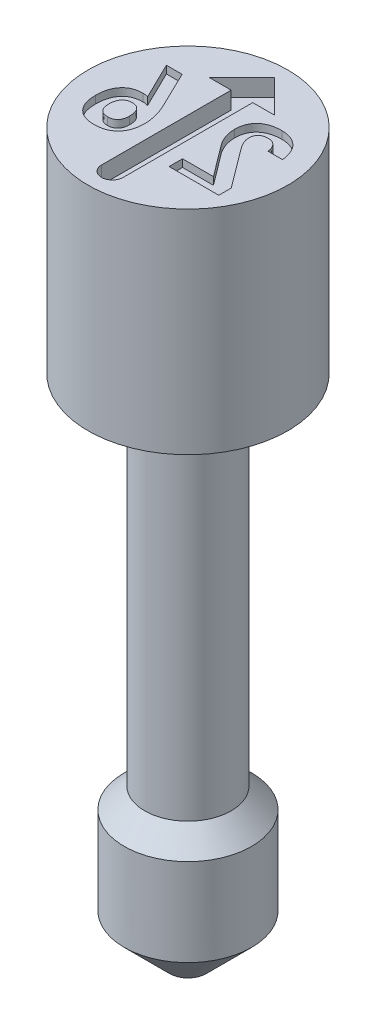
ISO-10303-21;
HEADER;
FILE_DESCRIPTION(('STEP AP214'),'2;1');
FILE_NAME('part.step','',(''),(''),'','','');
FILE_SCHEMA(('AUTOMOTIVE_DESIGN { 1 0 10303 214 1 1 1 1 }'));
ENDSEC;
DATA;
#1=APPLICATION_CONTEXT('core data for automotive mechanical design processes');
#2=APPLICATION_PROTOCOL_DEFINITION('international standard','automotive_design',2000,#1);
#3=PRODUCT_CONTEXT('',#1,'mechanical');
#4=PRODUCT('Part','Part','',(#3));
#5=PRODUCT_RELATED_PRODUCT_CATEGORY('part','',(#4));
#6=PRODUCT_DEFINITION_FORMATION('','',#4);
#7=PRODUCT_DEFINITION_CONTEXT('part definition',#1,'design');
#8=PRODUCT_DEFINITION('design','',#6,#7);
#9=PRODUCT_DEFINITION_SHAPE('','',#8);
#10=(LENGTH_UNIT() NAMED_UNIT(*) SI_UNIT(.MILLI.,.METRE.));
#11=(NAMED_UNIT(*) PLANE_ANGLE_UNIT() SI_UNIT($,.RADIAN.));
#12=(NAMED_UNIT(*) SI_UNIT($,.STERADIAN.) SOLID_ANGLE_UNIT());
#13=UNCERTAINTY_MEASURE_WITH_UNIT(LENGTH_MEASURE(1.E-05),#10,'distance_accuracy_value','');
#14=(GEOMETRIC_REPRESENTATION_CONTEXT(3) GLOBAL_UNCERTAINTY_ASSIGNED_CONTEXT((#13)) GLOBAL_UNIT_ASSIGNED_CONTEXT((#10,
#11,#12)) REPRESENTATION_CONTEXT('',''));
#15=CARTESIAN_POINT('',(0.,0.,0.));
#16=DIRECTION('',(0.,0.,1.));
#17=DIRECTION('',(1.,0.,0.));
#18=AXIS2_PLACEMENT_3D('',#15,#16,#17);
#19=CARTESIAN_POINT('',(0.,17.018,0.));
#20=DIRECTION('',(0.,1.,0.));
#21=DIRECTION('',(0.,0.,1.));
#22=AXIS2_PLACEMENT_3D('',#19,#20,#21);
#23=PLANE('',#22);
#24=DIRECTION('',(1.,0.,0.));
#25=VECTOR('',#24,1.);
#26=CARTESIAN_POINT('',(0.571912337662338,17.018,1.016));
#27=LINE('',#26,#25);
#28=CARTESIAN_POINT('',(0.571912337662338,17.018,1.016));
#29=VERTEX_POINT('',#28);
#30=CARTESIAN_POINT('',(1.74088961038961,17.018,1.016));
#31=VERTEX_POINT('',#30);
#32=EDGE_CURVE('E52',#29,#31,#27,.T.);
#33=ORIENTED_EDGE('',*,*,#32,.F.);
#34=DIRECTION('',(0.,0.,1.));
#35=VECTOR('',#34,1.);
#36=CARTESIAN_POINT('',(0.571912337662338,17.018,0.699324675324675));
#37=LINE('',#36,#35);
#38=CARTESIAN_POINT('',(0.571912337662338,17.018,0.699324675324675));
#39=VERTEX_POINT('',#38);
#40=EDGE_CURVE('E315',#39,#29,#37,.T.);
#41=ORIENTED_EDGE('',*,*,#40,.F.);
#42=DIRECTION('',(-1.,0.,0.));
#43=VECTOR('',#42,1.);
#44=CARTESIAN_POINT('',(1.29968831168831,17.018,0.699324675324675));
#45=LINE('',#44,#43);
#46=CARTESIAN_POINT('',(1.29968831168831,17.018,0.699324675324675));
#47=VERTEX_POINT('',#46);
#48=EDGE_CURVE('E318',#47,#39,#45,.T.);
#49=ORIENTED_EDGE('',*,*,#48,.F.);
#50=DIRECTION('',(0.601464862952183,0.,0.798899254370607));
#51=VECTOR('',#50,1.);
#52=CARTESIAN_POINT('',(0.758288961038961,17.018,-0.0197922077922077));
#53=LINE('',#52,#51);
#54=CARTESIAN_POINT('',(0.758288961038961,17.018,-0.0197922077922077));
#55=VERTEX_POINT('',#54);
#56=EDGE_CURVE('E1378',#55,#47,#53,.T.);
#57=ORIENTED_EDGE('',*,*,#56,.F.);
#58=CARTESIAN_POINT('',(0.583045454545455,17.018,-0.508824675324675));
#59=CARTESIAN_POINT('',(0.583586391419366,17.018,-0.488036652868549));
#60=CARTESIAN_POINT('',(0.584672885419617,17.018,-0.446283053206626));
#61=CARTESIAN_POINT('',(0.594069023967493,17.018,-0.383460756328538));
#62=CARTESIAN_POINT('',(0.607637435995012,17.018,-0.319985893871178));
#63=CARTESIAN_POINT('',(0.628261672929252,17.018,-0.256774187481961));
#64=CARTESIAN_POINT('',(0.65310078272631,17.018,-0.194185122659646));
#65=CARTESIAN_POINT('',(0.683386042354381,17.018,-0.133645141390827));
#66=CARTESIAN_POINT('',(0.71794772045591,17.018,-0.0749749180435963));
#67=CARTESIAN_POINT('',(0.744778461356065,17.018,-0.0382731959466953));
#68=CARTESIAN_POINT('',(0.758288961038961,17.018,-0.0197922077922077));
#69=B_SPLINE_CURVE_WITH_KNOTS('',3,(#58,#59,#60,#61,#62,#63,#64,#65,#66,#67,#68),.UNSPECIFIED.,
.F.,.F.,(4,1,1,1,1,1,1,1,4),(0.,0.117962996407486,0.236933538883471,0.360005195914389,
0.486119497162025,0.613931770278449,0.742012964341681,0.870091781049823,1.),.UNSPECIFIED.);
#70=CARTESIAN_POINT('',(0.583045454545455,17.018,-0.508824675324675));
#71=VERTEX_POINT('',#70);
#72=EDGE_CURVE('E1373',#71,#55,#69,.T.);
#73=ORIENTED_EDGE('',*,*,#72,.F.);
#74=DIRECTION('',(0.,0.,1.));
#75=VECTOR('',#74,1.);
#76=CARTESIAN_POINT('',(0.583045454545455,17.018,-0.510061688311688));
#77=LINE('',#76,#75);
#78=CARTESIAN_POINT('',(0.583045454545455,17.018,-0.510061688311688));
#79=VERTEX_POINT('',#78);
#80=EDGE_CURVE('E1367',#79,#71,#77,.T.);
#81=ORIENTED_EDGE('',*,*,#80,.F.);
#82=CARTESIAN_POINT('',(1.16732792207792,17.018,-1.04238961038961));
#83=CARTESIAN_POINT('',(1.14463082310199,17.018,-1.04205905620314));
#84=CARTESIAN_POINT('',(1.10050874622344,17.018,-1.04141647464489));
#85=CARTESIAN_POINT('',(1.03643838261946,17.018,-1.03457908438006));
#86=CARTESIAN_POINT('',(0.976258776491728,17.018,-1.02407863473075));
#87=CARTESIAN_POINT('',(0.920021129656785,17.018,-1.0089138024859));
#88=CARTESIAN_POINT('',(0.867836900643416,17.018,-0.989080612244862));
#89=CARTESIAN_POINT('',(0.819657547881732,17.018,-0.964997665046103));
#90=CARTESIAN_POINT('',(0.775168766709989,17.018,-0.937016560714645));
#91=CARTESIAN_POINT('',(0.735030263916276,17.018,-0.904188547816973));
#92=CARTESIAN_POINT('',(0.699184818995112,17.018,-0.867564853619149));
#93=CARTESIAN_POINT('',(0.667824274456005,17.018,-0.827280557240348));
#94=CARTESIAN_POINT('',(0.641938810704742,17.018,-0.782987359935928));
#95=CARTESIAN_POINT('',(0.619676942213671,17.018,-0.735578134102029));
#96=CARTESIAN_POINT('',(0.603562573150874,17.018,-0.684023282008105));
#97=CARTESIAN_POINT('',(0.591433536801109,17.018,-0.629288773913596));
#98=CARTESIAN_POINT('',(0.58449216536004,17.018,-0.57085274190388));
#99=CARTESIAN_POINT('',(0.583536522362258,17.018,-0.530696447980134));
#100=CARTESIAN_POINT('',(0.583045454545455,17.018,-0.510061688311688));
#101=B_SPLINE_CURVE_WITH_KNOTS('',3,(#82,#83,#84,#85,#86,#87,#88,#89,#90,#91,#92,#93,#94,#95,
#96,#97,#98,#99,#100),.UNSPECIFIED.,.F.,.F.,(4,1,1,1,1,1,1,1,1,1,1,1,1,1,1,1,4),(0.,
0.0757177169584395,0.147191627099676,0.214761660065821,0.279410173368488,0.341256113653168,
0.400743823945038,0.458895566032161,0.516277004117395,0.573364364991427,0.629605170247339,
0.686164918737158,0.744246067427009,0.804009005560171,0.865999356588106,0.931142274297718,1.),.UNSPECIFIED.);
#102=CARTESIAN_POINT('',(1.16732792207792,17.018,-1.04238961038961));
#103=VERTEX_POINT('',#102);
#104=EDGE_CURVE('E1359',#103,#79,#101,.T.);
#105=ORIENTED_EDGE('',*,*,#104,.F.);
#106=CARTESIAN_POINT('',(1.76562987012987,17.018,-0.460581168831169));
#107=CARTESIAN_POINT('',(1.76299223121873,17.018,-0.483184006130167));
#108=CARTESIAN_POINT('',(1.75784404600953,17.018,-0.52730058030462));
#109=CARTESIAN_POINT('',(1.74384154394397,17.018,-0.590874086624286));
#110=CARTESIAN_POINT('',(1.7267087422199,17.018,-0.650658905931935));
#111=CARTESIAN_POINT('',(1.7052446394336,17.018,-0.706576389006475));
#112=CARTESIAN_POINT('',(1.67963027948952,17.018,-0.758546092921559));
#113=CARTESIAN_POINT('',(1.6504377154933,17.018,-0.806952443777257));
#114=CARTESIAN_POINT('',(1.61620982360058,17.018,-0.850632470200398));
#115=CARTESIAN_POINT('',(1.57886153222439,17.018,-0.89089098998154));
#116=CARTESIAN_POINT('',(1.53743513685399,17.018,-0.926274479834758));
#117=CARTESIAN_POINT('',(1.49313427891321,17.018,-0.957382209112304));
#118=CARTESIAN_POINT('',(1.44596817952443,17.018,-0.983940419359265));
#119=CARTESIAN_POINT('',(1.39578374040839,17.018,-1.00548058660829));
#120=CARTESIAN_POINT('',(1.34265845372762,17.018,-1.02187735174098));
#121=CARTESIAN_POINT('',(1.28680347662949,17.018,-1.03390789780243));
#122=CARTESIAN_POINT('',(1.22798279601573,17.018,-1.04092463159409));
#123=CARTESIAN_POINT('',(1.1878260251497,17.018,-1.04189452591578));
#124=CARTESIAN_POINT('',(1.16732792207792,17.018,-1.04238961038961));
#125=B_SPLINE_CURVE_WITH_KNOTS('',3,(#106,#107,#108,#109,#110,#111,#112,#113,#114,#115,#116,
#117,#118,#119,#120,#121,#122,#123,#124),.UNSPECIFIED.,.F.,.F.,(4,1,1,1,1,1,1,1,1,1,1,1,1,1,1,1,
4),(0.,0.0735286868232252,0.143514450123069,0.210169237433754,0.274454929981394,
0.336856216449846,0.397291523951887,0.456843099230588,0.515945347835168,0.574554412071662,
0.632618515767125,0.690713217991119,0.749236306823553,0.808827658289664,0.870185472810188,
0.9337359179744,1.),.UNSPECIFIED.);
#126=CARTESIAN_POINT('',(1.76562987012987,17.018,-0.460581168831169));
#127=VERTEX_POINT('',#126);
#128=EDGE_CURVE('E1354',#127,#103,#125,.T.);
#129=ORIENTED_EDGE('',*,*,#128,.F.);
#130=DIRECTION('',(0.,0.,-1.));
#131=VECTOR('',#130,1.);
#132=CARTESIAN_POINT('',(1.76562987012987,17.018,-0.459344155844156));
#133=LINE('',#132,#131);
#134=CARTESIAN_POINT('',(1.76562987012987,17.018,-0.459344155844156));
#135=VERTEX_POINT('',#134);
#136=EDGE_CURVE('E1351',#135,#127,#133,.T.);
#137=ORIENTED_EDGE('',*,*,#136,.F.);
#138=DIRECTION('',(1.,0.,0.));
#139=VECTOR('',#138,1.);
#140=CARTESIAN_POINT('',(1.42338961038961,17.018,-0.459344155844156));
#141=LINE('',#140,#139);
#142=CARTESIAN_POINT('',(1.42338961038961,17.018,-0.459344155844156));
#143=VERTEX_POINT('',#142);
#144=EDGE_CURVE('E1348',#143,#135,#141,.T.);
#145=ORIENTED_EDGE('',*,*,#144,.F.);
#146=DIRECTION('',(0.,0.,1.));
#147=VECTOR('',#146,1.);
#148=CARTESIAN_POINT('',(1.42338961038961,17.018,-0.460581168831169));
#149=LINE('',#148,#147);
#150=CARTESIAN_POINT('',(1.42338961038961,17.018,-0.460581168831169));
#151=VERTEX_POINT('',#150);
#152=EDGE_CURVE('E1342',#151,#143,#149,.T.);
#153=ORIENTED_EDGE('',*,*,#152,.F.);
#154=CARTESIAN_POINT('',(1.16444155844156,17.018,-0.725714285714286));
#155=CARTESIAN_POINT('',(1.18158948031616,17.018,-0.725074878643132));
#156=CARTESIAN_POINT('',(1.21479350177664,17.018,-0.723836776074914));
#157=CARTESIAN_POINT('',(1.26192448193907,17.018,-0.709847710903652));
#158=CARTESIAN_POINT('',(1.30465343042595,17.018,-0.688354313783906));
#159=CARTESIAN_POINT('',(1.34147193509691,17.018,-0.657296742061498));
#160=CARTESIAN_POINT('',(1.37241700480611,17.018,-0.618583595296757));
#161=CARTESIAN_POINT('',(1.39694780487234,17.018,-0.572517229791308));
#162=CARTESIAN_POINT('',(1.4141220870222,17.018,-0.518966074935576));
#163=CARTESIAN_POINT('',(1.42020857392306,17.018,-0.480621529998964));
#164=CARTESIAN_POINT('',(1.42338961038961,17.018,-0.460581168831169));
#165=B_SPLINE_CURVE_WITH_KNOTS('',3,(#154,#155,#156,#157,#158,#159,#160,#161,#162,#163,#164),
.UNSPECIFIED.,.F.,.F.,(4,1,1,1,1,1,1,1,4),(0.,0.124986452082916,0.242014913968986,
0.356148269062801,0.472436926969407,0.591058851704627,0.716468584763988,0.851815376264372,1.),.UNSPECIFIED.);
#166=CARTESIAN_POINT('',(1.16444155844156,17.018,-0.725714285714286));
#167=VERTEX_POINT('',#166);
#168=EDGE_CURVE('E1334',#167,#151,#165,.T.);
#169=ORIENTED_EDGE('',*,*,#168,.F.);
#170=CARTESIAN_POINT('',(0.926522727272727,17.018,-0.510061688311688));
#171=CARTESIAN_POINT('',(0.927078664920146,17.018,-0.526368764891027));
#172=CARTESIAN_POINT('',(0.928141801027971,17.018,-0.557553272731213));
#173=CARTESIAN_POINT('',(0.940472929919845,17.018,-0.601204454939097));
#174=CARTESIAN_POINT('',(0.960073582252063,17.018,-0.639185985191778));
#175=CARTESIAN_POINT('',(0.988022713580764,17.018,-0.670613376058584));
#176=CARTESIAN_POINT('',(1.02279637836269,17.018,-0.69562289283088));
#177=CARTESIAN_POINT('',(1.06434206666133,17.018,-0.713667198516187));
#178=CARTESIAN_POINT('',(1.11243653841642,17.018,-0.723610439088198));
#179=CARTESIAN_POINT('',(1.14652803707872,17.018,-0.724989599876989));
#180=CARTESIAN_POINT('',(1.16444155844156,17.018,-0.725714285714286));
#181=B_SPLINE_CURVE_WITH_KNOTS('',3,(#170,#171,#172,#173,#174,#175,#176,#177,#178,#179,#180),
.UNSPECIFIED.,.F.,.F.,(4,1,1,1,1,1,1,1,4),(0.,0.133827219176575,0.255921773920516,
0.369738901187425,0.482715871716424,0.598532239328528,0.719553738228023,0.852638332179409,1.),.UNSPECIFIED.);
#182=CARTESIAN_POINT('',(0.926522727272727,17.018,-0.510061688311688));
#183=VERTEX_POINT('',#182);
#184=EDGE_CURVE('E1329',#183,#167,#181,.T.);
#185=ORIENTED_EDGE('',*,*,#184,.F.);
#186=DIRECTION('',(0.,0.,-1.));
#187=VECTOR('',#186,1.);
#188=CARTESIAN_POINT('',(0.926522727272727,17.018,-0.507175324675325));
#189=LINE('',#188,#187);
#190=CARTESIAN_POINT('',(0.926522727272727,17.018,-0.507175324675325));
#191=VERTEX_POINT('',#190);
#192=EDGE_CURVE('E1323',#191,#183,#189,.T.);
#193=ORIENTED_EDGE('',*,*,#192,.F.);
#194=CARTESIAN_POINT('',(1.04074025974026,17.018,-0.215652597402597));
#195=CARTESIAN_POINT('',(1.03207600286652,17.018,-0.227648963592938));
#196=CARTESIAN_POINT('',(1.01499091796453,17.018,-0.251304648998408));
#197=CARTESIAN_POINT('',(0.992128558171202,17.018,-0.288084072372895));
#198=CARTESIAN_POINT('',(0.972869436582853,17.018,-0.325721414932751));
#199=CARTESIAN_POINT('',(0.956261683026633,17.018,-0.363521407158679));
#200=CARTESIAN_POINT('',(0.943253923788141,17.018,-0.401045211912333));
#201=CARTESIAN_POINT('',(0.933426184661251,17.018,-0.437499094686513));
#202=CARTESIAN_POINT('',(0.928004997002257,17.018,-0.472789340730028));
#203=CARTESIAN_POINT('',(0.927009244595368,17.018,-0.495889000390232));
#204=CARTESIAN_POINT('',(0.926522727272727,17.018,-0.507175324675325));
#205=B_SPLINE_CURVE_WITH_KNOTS('',3,(#194,#195,#196,#197,#198,#199,#200,#201,#202,#203,#204),
.UNSPECIFIED.,.F.,.F.,(4,1,1,1,1,1,1,1,4),(0.,0.139527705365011,0.275135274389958,
0.407888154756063,0.537917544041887,0.66417107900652,0.782063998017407,0.893518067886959,1.),.UNSPECIFIED.);
#206=CARTESIAN_POINT('',(1.04074025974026,17.018,-0.215652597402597));
#207=VERTEX_POINT('',#206);
#208=EDGE_CURVE('E1318',#207,#191,#205,.T.);
#209=ORIENTED_EDGE('',*,*,#208,.F.);
#210=DIRECTION('',(-0.597969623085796,0.,-0.801518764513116));
#211=VECTOR('',#210,1.);
#212=CARTESIAN_POINT('',(1.74088961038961,17.018,0.722827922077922));
#213=LINE('',#212,#211);
#214=CARTESIAN_POINT('',(1.74088961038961,17.018,0.722827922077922));
#215=VERTEX_POINT('',#214);
#216=EDGE_CURVE('E1315',#215,#207,#213,.T.);
#217=ORIENTED_EDGE('',*,*,#216,.F.);
#218=DIRECTION('',(0.,0.,-1.));
#219=VECTOR('',#218,1.);
#220=CARTESIAN_POINT('',(1.74088961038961,17.018,1.016));
#221=LINE('',#220,#219);
#222=EDGE_CURVE('E1313',#31,#215,#221,.T.);
#223=ORIENTED_EDGE('',*,*,#222,.F.);
#224=EDGE_LOOP('',(#33,#41,#49,#57,#73,#81,#105,#129,#137,#145,#153,#169,#185,#193,#209,#217,#223));
#225=FACE_BOUND('',#224,.T.);
#226=CARTESIAN_POINT('',(-1.74428727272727,17.018,0.429243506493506));
#227=CARTESIAN_POINT('',(-1.74381176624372,17.018,0.452903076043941));
#228=CARTESIAN_POINT('',(-1.74288621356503,17.018,0.498955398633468));
#229=CARTESIAN_POINT('',(-1.73573391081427,17.018,0.565941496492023));
#230=CARTESIAN_POINT('',(-1.72444200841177,17.018,0.628911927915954));
#231=CARTESIAN_POINT('',(-1.70797215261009,17.018,0.687775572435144));
#232=CARTESIAN_POINT('',(-1.6864802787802,17.018,0.742459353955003));
#233=CARTESIAN_POINT('',(-1.66028770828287,17.018,0.79310828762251));
#234=CARTESIAN_POINT('',(-1.62993457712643,17.018,0.840050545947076));
#235=CARTESIAN_POINT('',(-1.59419052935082,17.018,0.882148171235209));
#236=CARTESIAN_POINT('',(-1.55438366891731,17.018,0.919902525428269));
#237=CARTESIAN_POINT('',(-1.5106005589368,17.018,0.953160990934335));
#238=CARTESIAN_POINT('',(-1.4625500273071,17.018,0.980727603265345));
#239=CARTESIAN_POINT('',(-1.41062837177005,17.018,1.00320195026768));
#240=CARTESIAN_POINT('',(-1.35494612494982,17.018,1.02082172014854));
#241=CARTESIAN_POINT('',(-1.29519201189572,17.018,1.03365526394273));
#242=CARTESIAN_POINT('',(-1.23152545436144,17.018,1.04102552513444));
#243=CARTESIAN_POINT('',(-1.18778804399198,17.018,1.04192729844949));
#244=CARTESIAN_POINT('',(-1.1653651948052,17.018,1.04238961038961));
#245=B_SPLINE_CURVE_WITH_KNOTS('',3,(#226,#227,#228,#229,#230,#231,#232,#233,#234,#235,#236,
#237,#238,#239,#240,#241,#242,#243,#244),.UNSPECIFIED.,.F.,.F.,(4,1,1,1,1,1,1,1,1,1,1,1,1,1,1,1,
4),(0.,0.0739861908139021,0.144010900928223,0.210453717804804,0.273873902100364,
0.334863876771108,0.393890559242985,0.451957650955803,0.50931223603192,0.5661765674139,
0.62326632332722,0.680854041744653,0.738995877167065,0.7999039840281,0.863226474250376,
0.929880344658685,1.),.UNSPECIFIED.);
#246=CARTESIAN_POINT('',(-1.74428727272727,17.018,0.429243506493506));
#247=VERTEX_POINT('',#246);
#248=CARTESIAN_POINT('',(-1.1653651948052,17.018,1.04238961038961));
#249=VERTEX_POINT('',#248);
#250=EDGE_CURVE('E60',#247,#249,#245,.T.);
#251=ORIENTED_EDGE('',*,*,#250,.F.);
#252=DIRECTION('',(0.,0.,1.));
#253=VECTOR('',#252,1.);
#254=CARTESIAN_POINT('',(-1.74428727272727,17.018,0.428006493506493));
#255=LINE('',#254,#253);
#256=CARTESIAN_POINT('',(-1.74428727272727,17.018,0.428006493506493));
#257=VERTEX_POINT('',#256);
#258=EDGE_CURVE('E436',#257,#247,#255,.T.);
#259=ORIENTED_EDGE('',*,*,#258,.F.);
#260=CARTESIAN_POINT('',(-1.23092688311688,17.018,-0.171532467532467));
#261=CARTESIAN_POINT('',(-1.25060949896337,17.018,-0.171091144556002));
#262=CARTESIAN_POINT('',(-1.28915788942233,17.018,-0.170226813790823));
#263=CARTESIAN_POINT('',(-1.34515134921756,17.018,-0.162499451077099));
#264=CARTESIAN_POINT('',(-1.39800636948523,17.018,-0.151018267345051));
#265=CARTESIAN_POINT('',(-1.44698247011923,17.018,-0.133152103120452));
#266=CARTESIAN_POINT('',(-1.49317586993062,17.018,-0.111688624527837));
#267=CARTESIAN_POINT('',(-1.53533176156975,17.018,-0.0839701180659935));
#268=CARTESIAN_POINT('',(-1.57449753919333,17.018,-0.0520914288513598));
#269=CARTESIAN_POINT('',(-1.60998502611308,17.018,-0.0152061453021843));
#270=CARTESIAN_POINT('',(-1.64177590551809,17.018,0.026142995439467));
#271=CARTESIAN_POINT('',(-1.6694644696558,17.018,0.0716132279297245));
#272=CARTESIAN_POINT('',(-1.69260831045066,17.018,0.121174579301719));
#273=CARTESIAN_POINT('',(-1.71164751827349,17.018,0.174745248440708));
#274=CARTESIAN_POINT('',(-1.72625954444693,17.018,0.232478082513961));
#275=CARTESIAN_POINT('',(-1.73701411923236,17.018,0.294072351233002));
#276=CARTESIAN_POINT('',(-1.74317524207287,17.018,0.359706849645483));
#277=CARTESIAN_POINT('',(-1.74390886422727,17.018,0.40476507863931));
#278=CARTESIAN_POINT('',(-1.74428727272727,17.018,0.428006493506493));
#279=B_SPLINE_CURVE_WITH_KNOTS('',3,(#260,#261,#262,#263,#264,#265,#266,#267,#268,#269,#270,
#271,#272,#273,#274,#275,#276,#277,#278),.UNSPECIFIED.,.F.,.F.,(4,1,1,1,1,1,1,1,1,1,1,1,1,1,1,1,
4),(0.,0.065875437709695,0.129017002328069,0.188974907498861,0.246623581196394,
0.303237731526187,0.359155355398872,0.415082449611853,0.472045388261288,0.530135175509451,
0.589416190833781,0.649949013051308,0.712984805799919,0.779517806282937,0.849133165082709,
0.922181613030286,1.),.UNSPECIFIED.);
#280=CARTESIAN_POINT('',(-1.23092688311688,17.018,-0.171532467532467));
#281=VERTEX_POINT('',#280);
#282=EDGE_CURVE('E615',#281,#257,#279,.T.);
#283=ORIENTED_EDGE('',*,*,#282,.F.);
#284=CARTESIAN_POINT('',(-0.973215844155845,17.018,-0.0350487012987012));
#285=CARTESIAN_POINT('',(-0.979463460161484,17.018,-0.0460096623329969));
#286=CARTESIAN_POINT('',(-0.991711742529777,17.018,-0.0674983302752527));
#287=CARTESIAN_POINT('',(-1.01583253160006,17.018,-0.0952307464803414));
#288=CARTESIAN_POINT('',(-1.04274193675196,17.018,-0.119251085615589));
#289=CARTESIAN_POINT('',(-1.07384167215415,17.018,-0.138302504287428));
#290=CARTESIAN_POINT('',(-1.10831206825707,17.018,-0.153148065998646));
#291=CARTESIAN_POINT('',(-1.14616619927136,17.018,-0.163753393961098));
#292=CARTESIAN_POINT('',(-1.18738471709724,17.018,-0.170593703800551));
#293=CARTESIAN_POINT('',(-1.21605372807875,17.018,-0.171211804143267));
#294=CARTESIAN_POINT('',(-1.23092688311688,17.018,-0.171532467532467));
#295=B_SPLINE_CURVE_WITH_KNOTS('',3,(#284,#285,#286,#287,#288,#289,#290,#291,#292,#293,#294),
.UNSPECIFIED.,.F.,.F.,(4,1,1,1,1,1,1,1,4),(0.,0.122662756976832,0.240477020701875,
0.356264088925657,0.472961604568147,0.594130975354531,0.720885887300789,0.855198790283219,1.),.UNSPECIFIED.);
#296=CARTESIAN_POINT('',(-1.10045083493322,17.018,-0.149328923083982));
#297=VERTEX_POINT('',#296);
#298=EDGE_CURVE('E620',#297,#281,#295,.T.);
#299=ORIENTED_EDGE('',*,*,#298,.F.);
#300=DIRECTION('',(0.438125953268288,0.,0.898913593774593));
#301=VECTOR('',#300,1.);
#302=CARTESIAN_POINT('',(-1.52286194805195,17.018,-1.016));
#303=LINE('',#302,#301);
#304=CARTESIAN_POINT('',(-1.52286194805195,17.018,-1.016));
#305=VERTEX_POINT('',#304);
#306=EDGE_CURVE('E628',#305,#297,#303,.T.);
#307=ORIENTED_EDGE('',*,*,#306,.F.);
#308=DIRECTION('',(-1.,0.,0.));
#309=VECTOR('',#308,1.);
#310=CARTESIAN_POINT('',(-1.15423207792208,17.018,-1.016));
#311=LINE('',#310,#309);
#312=CARTESIAN_POINT('',(-1.15423207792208,17.018,-1.016));
#313=VERTEX_POINT('',#312);
#314=EDGE_CURVE('E634',#313,#305,#311,.T.);
#315=ORIENTED_EDGE('',*,*,#314,.F.);
#316=DIRECTION('',(-0.436864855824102,0.,-0.899527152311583));
#317=VECTOR('',#316,1.);
#318=CARTESIAN_POINT('',(-0.728287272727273,17.018,-0.138957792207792));
#319=LINE('',#318,#317);
#320=CARTESIAN_POINT('',(-0.728287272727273,17.018,-0.138957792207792));
#321=VERTEX_POINT('',#320);
#322=EDGE_CURVE('E637',#321,#313,#319,.T.);
#323=ORIENTED_EDGE('',*,*,#322,.F.);
#324=CARTESIAN_POINT('',(-0.58768012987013,17.018,0.425944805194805));
#325=CARTESIAN_POINT('',(-0.588247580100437,17.018,0.403666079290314));
#326=CARTESIAN_POINT('',(-0.589402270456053,17.018,0.358331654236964));
#327=CARTESIAN_POINT('',(-0.59603720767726,17.018,0.289420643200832));
#328=CARTESIAN_POINT('',(-0.607883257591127,17.018,0.218718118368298));
#329=CARTESIAN_POINT('',(-0.623720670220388,17.018,0.146517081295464));
#330=CARTESIAN_POINT('',(-0.64458941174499,17.018,0.0740330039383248));
#331=CARTESIAN_POINT('',(-0.668179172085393,17.018,0.00171511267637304));
#332=CARTESIAN_POINT('',(-0.696434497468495,17.018,-0.0692777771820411));
#333=CARTESIAN_POINT('',(-0.717645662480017,17.018,-0.115678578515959));
#334=CARTESIAN_POINT('',(-0.728287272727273,17.018,-0.138957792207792));
#335=B_SPLINE_CURVE_WITH_KNOTS('',3,(#324,#325,#326,#327,#328,#329,#330,#331,#332,#333,#334),
.UNSPECIFIED.,.F.,.F.,(4,1,1,1,1,1,1,1,4),(0.,0.1139317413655,0.231836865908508,
0.353616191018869,0.480309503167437,0.609573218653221,0.73914226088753,0.869128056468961,1.),.UNSPECIFIED.);
#336=CARTESIAN_POINT('',(-0.58768012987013,17.018,0.425944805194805));
#337=VERTEX_POINT('',#336);
#338=EDGE_CURVE('E640',#337,#321,#335,.T.);
#339=ORIENTED_EDGE('',*,*,#338,.F.);
#340=DIRECTION('',(0.,0.,-1.));
#341=VECTOR('',#340,1.);
#342=CARTESIAN_POINT('',(-0.58768012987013,17.018,0.427181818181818));
#343=LINE('',#342,#341);
#344=CARTESIAN_POINT('',(-0.58768012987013,17.018,0.427181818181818));
#345=VERTEX_POINT('',#344);
#346=EDGE_CURVE('E645',#345,#337,#343,.T.);
#347=ORIENTED_EDGE('',*,*,#346,.F.);
#348=CARTESIAN_POINT('',(-1.1653651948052,17.018,1.04238961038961));
#349=CARTESIAN_POINT('',(-1.14307903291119,17.018,1.04193428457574));
#350=CARTESIAN_POINT('',(-1.09975071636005,17.018,1.0410490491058));
#351=CARTESIAN_POINT('',(-1.03663778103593,17.018,1.0336201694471));
#352=CARTESIAN_POINT('',(-0.977434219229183,17.018,1.02080917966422));
#353=CARTESIAN_POINT('',(-0.921960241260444,17.018,1.00320388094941));
#354=CARTESIAN_POINT('',(-0.870394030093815,17.018,0.980367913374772));
#355=CARTESIAN_POINT('',(-0.822663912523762,17.018,0.952600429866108));
#356=CARTESIAN_POINT('',(-0.778557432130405,17.018,0.919810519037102));
#357=CARTESIAN_POINT('',(-0.738561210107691,17.018,0.881865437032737));
#358=CARTESIAN_POINT('',(-0.703193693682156,17.018,0.839168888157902));
#359=CARTESIAN_POINT('',(-0.671761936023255,17.018,0.792717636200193));
#360=CARTESIAN_POINT('',(-0.645970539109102,17.018,0.741578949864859));
#361=CARTESIAN_POINT('',(-0.624435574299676,17.018,0.686665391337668));
#362=CARTESIAN_POINT('',(-0.608003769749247,17.018,0.627499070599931));
#363=CARTESIAN_POINT('',(-0.596131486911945,17.018,0.564474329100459));
#364=CARTESIAN_POINT('',(-0.589098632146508,17.018,0.497163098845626));
#365=CARTESIAN_POINT('',(-0.588162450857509,17.018,0.450976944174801));
#366=CARTESIAN_POINT('',(-0.58768012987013,17.018,0.427181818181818));
#367=B_SPLINE_CURVE_WITH_KNOTS('',3,(#348,#349,#350,#351,#352,#353,#354,#355,#356,#357,#358,
#359,#360,#361,#362,#363,#364,#365,#366),.UNSPECIFIED.,.F.,.F.,(4,1,1,1,1,1,1,1,1,1,1,1,1,1,1,1,
4),(0.,0.0696928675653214,0.13549549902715,0.198400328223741,0.258901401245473,
0.317218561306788,0.374436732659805,0.431270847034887,0.488745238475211,0.546431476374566,
0.604379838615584,0.663791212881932,0.725183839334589,0.788606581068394,0.855553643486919,
0.925581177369,1.),.UNSPECIFIED.);
#368=EDGE_CURVE('E651',#249,#345,#367,.T.);
#369=ORIENTED_EDGE('',*,*,#368,.F.);
#370=EDGE_LOOP('',(#251,#259,#283,#299,#307,#315,#323,#339,#347,#369));
#371=FACE_BOUND('',#370,.T.);
#372=CARTESIAN_POINT('',(0.,17.018,1.778));
#373=DIRECTION('',(0.,1.,0.));
#374=DIRECTION('',(0.,0.,1.));
#375=AXIS2_PLACEMENT_3D('',#372,#373,#374);
#376=CIRCLE('',#375,0.254);
#377=CARTESIAN_POINT('',(-0.254,17.018,1.778));
#378=VERTEX_POINT('',#377);
#379=CARTESIAN_POINT('',(0.254,17.018,1.778));
#380=VERTEX_POINT('',#379);
#381=EDGE_CURVE('E570',#378,#380,#376,.T.);
#382=ORIENTED_EDGE('',*,*,#381,.F.);
#383=DIRECTION('',(0.,0.,1.));
#384=VECTOR('',#383,1.);
#385=CARTESIAN_POINT('',(-0.254,17.018,1.778));
#386=LINE('',#385,#384);
#387=CARTESIAN_POINT('',(-0.254,17.018,-1.27));
#388=VERTEX_POINT('',#387);
#389=EDGE_CURVE('E551',#388,#378,#386,.T.);
#390=ORIENTED_EDGE('',*,*,#389,.F.);
#391=DIRECTION('',(1.,0.,0.));
#392=VECTOR('',#391,1.);
#393=CARTESIAN_POINT('',(-0.254,17.018,-1.27));
#394=LINE('',#393,#392);
#395=CARTESIAN_POINT('',(-0.762,17.018,-1.27));
#396=VERTEX_POINT('',#395);
#397=EDGE_CURVE('E555',#396,#388,#394,.T.);
#398=ORIENTED_EDGE('',*,*,#397,.F.);
#399=DIRECTION('',(-0.707106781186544,0.,0.707106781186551));
#400=VECTOR('',#399,1.);
#401=CARTESIAN_POINT('',(0.,17.018,-2.03200000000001));
#402=LINE('',#401,#400);
#403=CARTESIAN_POINT('',(0.,17.018,-2.03200000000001));
#404=VERTEX_POINT('',#403);
#405=EDGE_CURVE('E558',#404,#396,#402,.T.);
#406=ORIENTED_EDGE('',*,*,#405,.F.);
#407=DIRECTION('',(-0.707106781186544,0.,-0.707106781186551));
#408=VECTOR('',#407,1.);
#409=CARTESIAN_POINT('',(0.762,17.018,-1.27));
#410=LINE('',#409,#408);
#411=CARTESIAN_POINT('',(0.762,17.018,-1.27));
#412=VERTEX_POINT('',#411);
#413=EDGE_CURVE('E561',#412,#404,#410,.T.);
#414=ORIENTED_EDGE('',*,*,#413,.F.);
#415=DIRECTION('',(1.,0.,0.));
#416=VECTOR('',#415,1.);
#417=CARTESIAN_POINT('',(0.254,17.018,-1.27));
#418=LINE('',#417,#416);
#419=CARTESIAN_POINT('',(0.254,17.018,-1.27));
#420=VERTEX_POINT('',#419);
#421=EDGE_CURVE('E564',#420,#412,#418,.T.);
#422=ORIENTED_EDGE('',*,*,#421,.F.);
#423=DIRECTION('',(0.,0.,-1.));
#424=VECTOR('',#423,1.);
#425=CARTESIAN_POINT('',(0.254,17.018,1.778));
#426=LINE('',#425,#424);
#427=EDGE_CURVE('E567',#380,#420,#426,.T.);
#428=ORIENTED_EDGE('',*,*,#427,.F.);
#429=EDGE_LOOP('',(#382,#390,#398,#406,#414,#422,#428));
#430=FACE_BOUND('',#429,.T.);
#431=CARTESIAN_POINT('',(0.,17.018,0.));
#432=DIRECTION('',(0.,-1.,0.));
#433=DIRECTION('',(0.,0.,-1.));
#434=AXIS2_PLACEMENT_3D('',#431,#432,#433);
#435=CIRCLE('',#434,2.3495);
#436=CARTESIAN_POINT('',(0.,17.018,-2.3495));
#437=VERTEX_POINT('',#436);
#438=EDGE_CURVE('E11',#437,#437,#435,.T.);
#439=ORIENTED_EDGE('',*,*,#438,.F.);
#440=EDGE_LOOP('',(#439));
#441=FACE_BOUND('',#440,.T.);
#442=ADVANCED_FACE('F37',(#225,#371,#430,#441),#23,.T.);
#443=CARTESIAN_POINT('',(0.,0.,0.));
#444=DIRECTION('',(0.,-1.,0.));
#445=DIRECTION('',(0.,0.,-1.));
#446=AXIS2_PLACEMENT_3D('',#443,#444,#445);
#447=CYLINDRICAL_SURFACE('',#446,2.3495);
#448=ORIENTED_EDGE('',*,*,#438,.T.);
#449=EDGE_LOOP('',(#448));
#450=FACE_BOUND('',#449,.T.);
#451=CARTESIAN_POINT('',(0.,12.0142,0.));
#452=DIRECTION('',(0.,-1.,0.));
#453=DIRECTION('',(0.,0.,-1.));
#454=AXIS2_PLACEMENT_3D('',#451,#452,#453);
#455=CIRCLE('',#454,2.3495);
#456=CARTESIAN_POINT('',(0.,12.0142,-2.3495));
#457=VERTEX_POINT('',#456);
#458=EDGE_CURVE('E45',#457,#457,#455,.T.);
#459=ORIENTED_EDGE('',*,*,#458,.F.);
#460=EDGE_LOOP('',(#459));
#461=FACE_BOUND('',#460,.T.);
#462=ADVANCED_FACE('F507',(#450,#461),#447,.T.);
#463=CARTESIAN_POINT('',(2.3495,12.0142,0.));
#464=DIRECTION('',(0.,-1.,0.));
#465=DIRECTION('',(0.,0.,-1.));
#466=AXIS2_PLACEMENT_3D('',#463,#464,#465);
#467=PLANE('',#466);
#468=ORIENTED_EDGE('',*,*,#458,.T.);
#469=EDGE_LOOP('',(#468));
#470=FACE_BOUND('',#469,.T.);
#471=CARTESIAN_POINT('',(0.,12.0142,0.));
#472=DIRECTION('',(0.,-1.,0.));
#473=DIRECTION('',(0.,0.,-1.));
#474=AXIS2_PLACEMENT_3D('',#471,#472,#473);
#475=CIRCLE('',#474,1.016);
#476=CARTESIAN_POINT('',(0.,12.0142,-1.016));
#477=VERTEX_POINT('',#476);
#478=EDGE_CURVE('E519',#477,#477,#475,.T.);
#479=ORIENTED_EDGE('',*,*,#478,.F.);
#480=EDGE_LOOP('',(#479));
#481=FACE_BOUND('',#480,.T.);
#482=ADVANCED_FACE('F504',(#470,#481),#467,.T.);
#483=CARTESIAN_POINT('',(0.,0.,0.));
#484=DIRECTION('',(0.,-1.,0.));
#485=DIRECTION('',(0.,0.,-1.));
#486=AXIS2_PLACEMENT_3D('',#483,#484,#485);
#487=CYLINDRICAL_SURFACE('',#486,1.016);
#488=ORIENTED_EDGE('',*,*,#478,.T.);
#489=EDGE_LOOP('',(#488));
#490=FACE_BOUND('',#489,.T.);
#491=CARTESIAN_POINT('',(0.,3.6068,0.));
#492=DIRECTION('',(0.,-1.,0.));
#493=DIRECTION('',(0.,0.,-1.));
#494=AXIS2_PLACEMENT_3D('',#491,#492,#493);
#495=CIRCLE('',#494,1.016);
#496=CARTESIAN_POINT('',(0.,3.6068,-1.016));
#497=VERTEX_POINT('',#496);
#498=EDGE_CURVE('E521',#497,#497,#495,.T.);
#499=ORIENTED_EDGE('',*,*,#498,.F.);
#500=EDGE_LOOP('',(#499));
#501=FACE_BOUND('',#500,.T.);
#502=ADVANCED_FACE('F500',(#490,#501),#487,.T.);
#503=CARTESIAN_POINT('',(0.,3.12420000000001,0.));
#504=DIRECTION('',(0.,-1.,0.));
#505=DIRECTION('',(0.,0.,-1.));
#506=AXIS2_PLACEMENT_3D('',#503,#504,#505);
#507=CONICAL_SURFACE('',#506,1.4986,0.785398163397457);
#508=ORIENTED_EDGE('',*,*,#498,.T.);
#509=EDGE_LOOP('',(#508));
#510=FACE_BOUND('',#509,.T.);
#511=CARTESIAN_POINT('',(0.,3.12420000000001,0.));
#512=DIRECTION('',(0.,-1.,0.));
#513=DIRECTION('',(0.,0.,-1.));
#514=AXIS2_PLACEMENT_3D('',#511,#512,#513);
#515=CIRCLE('',#514,1.4986);
#516=CARTESIAN_POINT('',(0.,3.12420000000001,-1.4986));
#517=VERTEX_POINT('',#516);
#518=EDGE_CURVE('E526',#517,#517,#515,.T.);
#519=ORIENTED_EDGE('',*,*,#518,.F.);
#520=EDGE_LOOP('',(#519));
#521=FACE_BOUND('',#520,.T.);
#522=ADVANCED_FACE('F496',(#510,#521),#507,.T.);
#523=CARTESIAN_POINT('',(0.,0.,0.));
#524=DIRECTION('',(0.,-1.,0.));
#525=DIRECTION('',(0.,0.,-1.));
#526=AXIS2_PLACEMENT_3D('',#523,#524,#525);
#527=CYLINDRICAL_SURFACE('',#526,1.4986);
#528=ORIENTED_EDGE('',*,*,#518,.T.);
#529=EDGE_LOOP('',(#528));
#530=FACE_BOUND('',#529,.T.);
#531=CARTESIAN_POINT('',(0.,1.0668,0.));
#532=DIRECTION('',(0.,-1.,0.));
#533=DIRECTION('',(0.,0.,-1.));
#534=AXIS2_PLACEMENT_3D('',#531,#532,#533);
#535=CIRCLE('',#534,1.4986);
#536=CARTESIAN_POINT('',(0.,1.0668,1.4986));
#537=VERTEX_POINT('',#536);
#538=EDGE_CURVE('E529',#537,#537,#535,.T.);
#539=ORIENTED_EDGE('',*,*,#538,.F.);
#540=EDGE_LOOP('',(#539));
#541=FACE_BOUND('',#540,.T.);
#542=ADVANCED_FACE('F492',(#530,#541),#527,.T.);
#543=CARTESIAN_POINT('',(0.,0.,0.));
#544=DIRECTION('',(0.,1.,0.));
#545=DIRECTION('',(0.,0.,1.));
#546=AXIS2_PLACEMENT_3D('',#543,#544,#545);
#547=CONICAL_SURFACE('',#546,0.431800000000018,0.78539816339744);
#548=CARTESIAN_POINT('',(0.,0.,0.));
#549=DIRECTION('',(0.,-1.,0.));
#550=DIRECTION('',(0.,0.,-1.));
#551=AXIS2_PLACEMENT_3D('',#548,#549,#550);
#552=CIRCLE('',#551,0.431800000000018);
#553=CARTESIAN_POINT('',(0.,0.,0.431800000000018));
#554=VERTEX_POINT('',#553);
#555=EDGE_CURVE('E532',#554,#554,#552,.T.);
#556=CARTESIAN_POINT('',(0.,1.0668,1.4986));
#557=CARTESIAN_POINT('',(0.,1.0556875,1.4874875));
#558=CARTESIAN_POINT('',(0.,1.044575,1.476375));
#559=CARTESIAN_POINT('',(0.,1.02235,1.45415));
#560=CARTESIAN_POINT('',(0.,1.0112375,1.4430375));
#561=CARTESIAN_POINT('',(0.,0.9890125,1.4208125));
#562=CARTESIAN_POINT('',(0.,0.977900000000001,1.4097));
#563=CARTESIAN_POINT('',(0.,0.955675,1.387475));
#564=CARTESIAN_POINT('',(0.,0.944562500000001,1.3763625));
#565=CARTESIAN_POINT('',(0.,0.9223375,1.3541375));
#566=CARTESIAN_POINT('',(0.,0.911225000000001,1.343025));
#567=CARTESIAN_POINT('',(0.,0.889,1.3208));
#568=CARTESIAN_POINT('',(0.,0.8778875,1.3096875));
#569=CARTESIAN_POINT('',(0.,0.8556625,1.2874625));
#570=CARTESIAN_POINT('',(0.,0.84455,1.27635));
#571=CARTESIAN_POINT('',(0.,0.822325,1.254125));
#572=CARTESIAN_POINT('',(0.,0.8112125,1.2430125));
#573=CARTESIAN_POINT('',(0.,0.7889875,1.2207875));
#574=CARTESIAN_POINT('',(0.,0.777875,1.20967500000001));
#575=CARTESIAN_POINT('',(0.,0.75565,1.18745000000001));
#576=CARTESIAN_POINT('',(0.,0.744537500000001,1.17633750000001));
#577=CARTESIAN_POINT('',(0.,0.7223125,1.15411250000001));
#578=CARTESIAN_POINT('',(0.,0.7112,1.14300000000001));
#579=CARTESIAN_POINT('',(0.,0.688975,1.12077500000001));
#580=CARTESIAN_POINT('',(0.,0.6778625,1.10966250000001));
#581=CARTESIAN_POINT('',(0.,0.6556375,1.08743750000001));
#582=CARTESIAN_POINT('',(0.,0.644525,1.07632500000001));
#583=CARTESIAN_POINT('',(0.,0.6223,1.05410000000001));
#584=CARTESIAN_POINT('',(0.,0.6111875,1.04298750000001));
#585=CARTESIAN_POINT('',(0.,0.5889625,1.02076250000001));
#586=CARTESIAN_POINT('',(0.,0.57785,1.00965000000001));
#587=CARTESIAN_POINT('',(0.,0.555625,0.987425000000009));
#588=CARTESIAN_POINT('',(0.,0.5445125,0.976312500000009));
#589=CARTESIAN_POINT('',(0.,0.5222875,0.954087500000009));
#590=CARTESIAN_POINT('',(0.,0.511175,0.94297500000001));
#591=CARTESIAN_POINT('',(0.,0.48895,0.92075000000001));
#592=CARTESIAN_POINT('',(0.,0.4778375,0.90963750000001));
#593=CARTESIAN_POINT('',(0.,0.4556125,0.88741250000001));
#594=CARTESIAN_POINT('',(0.,0.4445,0.876300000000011));
#595=CARTESIAN_POINT('',(0.,0.422275,0.854075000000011));
#596=CARTESIAN_POINT('',(0.,0.4111625,0.842962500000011));
#597=CARTESIAN_POINT('',(0.,0.3889375,0.820737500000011));
#598=CARTESIAN_POINT('',(0.,0.377825,0.809625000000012));
#599=CARTESIAN_POINT('',(0.,0.3556,0.787400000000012));
#600=CARTESIAN_POINT('',(0.,0.3444875,0.776287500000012));
#601=CARTESIAN_POINT('',(0.,0.3222625,0.754062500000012));
#602=CARTESIAN_POINT('',(0.,0.31115,0.742950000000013));
#603=CARTESIAN_POINT('',(0.,0.288925,0.720725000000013));
#604=CARTESIAN_POINT('',(0.,0.2778125,0.709612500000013));
#605=CARTESIAN_POINT('',(0.,0.2555875,0.687387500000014));
#606=CARTESIAN_POINT('',(0.,0.244475,0.676275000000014));
#607=CARTESIAN_POINT('',(0.,0.22225,0.654050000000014));
#608=CARTESIAN_POINT('',(0.,0.2111375,0.642937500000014));
#609=CARTESIAN_POINT('',(0.,0.1889125,0.620712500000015));
#610=CARTESIAN_POINT('',(0.,0.1778,0.609600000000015));
#611=CARTESIAN_POINT('',(0.,0.155575,0.587375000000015));
#612=CARTESIAN_POINT('',(0.,0.1444625,0.576262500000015));
#613=CARTESIAN_POINT('',(0.,0.1222375,0.554037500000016));
#614=CARTESIAN_POINT('',(0.,0.111125,0.542925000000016));
#615=CARTESIAN_POINT('',(0.,0.0889,0.520700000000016));
#616=CARTESIAN_POINT('',(0.,0.0777875,0.509587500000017));
#617=CARTESIAN_POINT('',(0.,0.0555625,0.487362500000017));
#618=CARTESIAN_POINT('',(0.,0.04445,0.476250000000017));
#619=CARTESIAN_POINT('',(0.,0.022225,0.454025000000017));
#620=CARTESIAN_POINT('',(0.,0.0111125,0.442912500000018));
#621=CARTESIAN_POINT('',(0.,0.,0.431800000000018));
#622=B_SPLINE_CURVE_WITH_KNOTS('',3,(#556,#557,#558,#559,#560,#561,#562,#563,#564,#565,#566,
#567,#568,#569,#570,#571,#572,#573,#574,#575,#576,#577,#578,#579,#580,#581,#582,#583,#584,#585,
#586,#587,#588,#589,#590,#591,#592,#593,#594,#595,#596,#597,#598,#599,#600,#601,#602,#603,#604,
#605,#606,#607,#608,#609,#610,#611,#612,#613,#614,#615,#616,#617,#618,#619,#620,#621),
.UNSPECIFIED.,.F.,.F.,(4,2,2,2,2,2,2,2,2,2,2,2,2,2,2,2,2,2,2,2,2,2,2,2,2,2,2,2,2,2,2,2,4),(0.,
0.0471463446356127,0.0942926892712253,0.141439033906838,0.188585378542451,0.235731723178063,
0.282878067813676,0.330024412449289,0.377170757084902,0.424317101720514,0.471463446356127,
0.51860979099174,0.565756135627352,0.612902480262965,0.660048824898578,0.70719516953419,
0.754341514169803,0.801487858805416,0.848634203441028,0.895780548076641,0.942926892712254,
0.990073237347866,1.03721958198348,1.08436592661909,1.1315122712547,1.17865861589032,
1.22580496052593,1.27295130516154,1.32009764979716,1.36724399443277,1.41439033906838,
1.46153668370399,1.50868302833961),.UNSPECIFIED.);
#623=EDGE_CURVE('BSEAM488',#537,#554,#622,.T.);
#624=ORIENTED_EDGE('',*,*,#538,.T.);
#625=ORIENTED_EDGE('',*,*,#555,.F.);
#626=ORIENTED_EDGE('',*,*,#623,.T.);
#627=ORIENTED_EDGE('',*,*,#623,.F.);
#628=EDGE_LOOP('',(#624,#626,#625,#627));
#629=FACE_BOUND('',#628,.T.);
#630=ADVANCED_FACE('F488',(#629),#547,.T.);
#631=CARTESIAN_POINT('',(0.431800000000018,0.,0.));
#632=DIRECTION('',(0.,-1.,0.));
#633=DIRECTION('',(0.,0.,-1.));
#634=AXIS2_PLACEMENT_3D('',#631,#632,#633);
#635=PLANE('',#634);
#636=ORIENTED_EDGE('',*,*,#555,.T.);
#637=EDGE_LOOP('',(#636));
#638=FACE_BOUND('',#637,.T.);
#639=ADVANCED_FACE('F484',(#638),#635,.T.);
#640=CARTESIAN_POINT('',(0.,16.6116,1.778));
#641=DIRECTION('',(0.,1.,0.));
#642=DIRECTION('',(0.,0.,1.));
#643=AXIS2_PLACEMENT_3D('',#640,#641,#642);
#644=CYLINDRICAL_SURFACE('',#643,0.254);
#645=ORIENTED_EDGE('',*,*,#381,.T.);
#646=DIRECTION('',(0.,1.,0.));
#647=VECTOR('',#646,1.);
#648=CARTESIAN_POINT('',(0.254,16.6116,1.778));
#649=LINE('',#648,#647);
#650=CARTESIAN_POINT('',(0.254,16.6116,1.778));
#651=VERTEX_POINT('',#650);
#652=EDGE_CURVE('E536',#651,#380,#649,.T.);
#653=ORIENTED_EDGE('',*,*,#652,.F.);
#654=CARTESIAN_POINT('',(0.,16.6116,1.778));
#655=DIRECTION('',(0.,1.,0.));
#656=DIRECTION('',(0.,0.,1.));
#657=AXIS2_PLACEMENT_3D('',#654,#655,#656);
#658=CIRCLE('',#657,0.254);
#659=CARTESIAN_POINT('',(-0.254,16.6116,1.778));
#660=VERTEX_POINT('',#659);
#661=EDGE_CURVE('E554',#660,#651,#658,.T.);
#662=ORIENTED_EDGE('',*,*,#661,.F.);
#663=DIRECTION('',(0.,1.,0.));
#664=VECTOR('',#663,1.);
#665=CARTESIAN_POINT('',(-0.254,16.6116,1.778));
#666=LINE('',#665,#664);
#667=EDGE_CURVE('E535',#660,#378,#666,.T.);
#668=ORIENTED_EDGE('',*,*,#667,.T.);
#669=EDGE_LOOP('',(#645,#653,#662,#668));
#670=FACE_BOUND('',#669,.T.);
#671=ADVANCED_FACE('F462',(#670),#644,.F.);
#672=CARTESIAN_POINT('',(-0.254,16.6116,1.778));
#673=DIRECTION('',(-1.,0.,0.));
#674=DIRECTION('',(0.,0.,1.));
#675=AXIS2_PLACEMENT_3D('',#672,#673,#674);
#676=PLANE('',#675);
#677=ORIENTED_EDGE('',*,*,#389,.T.);
#678=ORIENTED_EDGE('',*,*,#667,.F.);
#679=DIRECTION('',(0.,0.,1.));
#680=VECTOR('',#679,1.);
#681=CARTESIAN_POINT('',(-0.254,16.6116,1.778));
#682=LINE('',#681,#680);
#683=CARTESIAN_POINT('',(-0.254,16.6116,-1.27));
#684=VERTEX_POINT('',#683);
#685=EDGE_CURVE('E540',#684,#660,#682,.T.);
#686=ORIENTED_EDGE('',*,*,#685,.F.);
#687=DIRECTION('',(0.,1.,0.));
#688=VECTOR('',#687,1.);
#689=CARTESIAN_POINT('',(-0.254,16.6116,-1.27));
#690=LINE('',#689,#688);
#691=EDGE_CURVE('E548',#684,#388,#690,.T.);
#692=ORIENTED_EDGE('',*,*,#691,.T.);
#693=EDGE_LOOP('',(#677,#678,#686,#692));
#694=FACE_BOUND('',#693,.T.);
#695=ADVANCED_FACE('F458',(#694),#676,.F.);
#696=CARTESIAN_POINT('',(-0.254,16.6116,-1.27));
#697=DIRECTION('',(0.,0.,1.));
#698=DIRECTION('',(1.,0.,0.));
#699=AXIS2_PLACEMENT_3D('',#696,#697,#698);
#700=PLANE('',#699);
#701=ORIENTED_EDGE('',*,*,#397,.T.);
#702=ORIENTED_EDGE('',*,*,#691,.F.);
#703=DIRECTION('',(1.,0.,0.));
#704=VECTOR('',#703,1.);
#705=CARTESIAN_POINT('',(-0.254,16.6116,-1.27));
#706=LINE('',#705,#704);
#707=CARTESIAN_POINT('',(-0.762,16.6116,-1.27));
#708=VERTEX_POINT('',#707);
#709=EDGE_CURVE('E575',#708,#684,#706,.T.);
#710=ORIENTED_EDGE('',*,*,#709,.F.);
#711=DIRECTION('',(0.,1.,0.));
#712=VECTOR('',#711,1.);
#713=CARTESIAN_POINT('',(-0.762,16.6116,-1.27));
#714=LINE('',#713,#712);
#715=EDGE_CURVE('E546',#708,#396,#714,.T.);
#716=ORIENTED_EDGE('',*,*,#715,.T.);
#717=EDGE_LOOP('',(#701,#702,#710,#716));
#718=FACE_BOUND('',#717,.T.);
#719=ADVANCED_FACE('F461',(#718),#700,.F.);
#720=CARTESIAN_POINT('',(0.,16.6116,-2.03200000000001));
#721=DIRECTION('',(-0.707106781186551,0.,-0.707106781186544));
#722=DIRECTION('',(-0.707106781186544,0.,0.707106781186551));
#723=AXIS2_PLACEMENT_3D('',#720,#721,#722);
#724=PLANE('',#723);
#725=ORIENTED_EDGE('',*,*,#405,.T.);
#726=ORIENTED_EDGE('',*,*,#715,.F.);
#727=DIRECTION('',(-0.707106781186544,0.,0.707106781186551));
#728=VECTOR('',#727,1.);
#729=CARTESIAN_POINT('',(0.,16.6116,-2.03200000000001));
#730=LINE('',#729,#728);
#731=CARTESIAN_POINT('',(0.,16.6116,-2.03200000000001));
#732=VERTEX_POINT('',#731);
#733=EDGE_CURVE('E578',#732,#708,#730,.T.);
#734=ORIENTED_EDGE('',*,*,#733,.F.);
#735=DIRECTION('',(0.,1.,0.));
#736=VECTOR('',#735,1.);
#737=CARTESIAN_POINT('',(0.,16.6116,-2.03200000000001));
#738=LINE('',#737,#736);
#739=EDGE_CURVE('E544',#732,#404,#738,.T.);
#740=ORIENTED_EDGE('',*,*,#739,.T.);
#741=EDGE_LOOP('',(#725,#726,#734,#740));
#742=FACE_BOUND('',#741,.T.);
#743=ADVANCED_FACE('F466',(#742),#724,.F.);
#744=CARTESIAN_POINT('',(0.762,16.6116,-1.27));
#745=DIRECTION('',(0.707106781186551,0.,-0.707106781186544));
#746=DIRECTION('',(-0.707106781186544,0.,-0.707106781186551));
#747=AXIS2_PLACEMENT_3D('',#744,#745,#746);
#748=PLANE('',#747);
#749=ORIENTED_EDGE('',*,*,#413,.T.);
#750=ORIENTED_EDGE('',*,*,#739,.F.);
#751=DIRECTION('',(-0.707106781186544,0.,-0.707106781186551));
#752=VECTOR('',#751,1.);
#753=CARTESIAN_POINT('',(0.762,16.6116,-1.27));
#754=LINE('',#753,#752);
#755=CARTESIAN_POINT('',(0.762,16.6116,-1.27));
#756=VERTEX_POINT('',#755);
#757=EDGE_CURVE('E581',#756,#732,#754,.T.);
#758=ORIENTED_EDGE('',*,*,#757,.F.);
#759=DIRECTION('',(0.,1.,0.));
#760=VECTOR('',#759,1.);
#761=CARTESIAN_POINT('',(0.762,16.6116,-1.27));
#762=LINE('',#761,#760);
#763=EDGE_CURVE('E542',#756,#412,#762,.T.);
#764=ORIENTED_EDGE('',*,*,#763,.T.);
#765=EDGE_LOOP('',(#749,#750,#758,#764));
#766=FACE_BOUND('',#765,.T.);
#767=ADVANCED_FACE('F470',(#766),#748,.F.);
#768=CARTESIAN_POINT('',(0.254,16.6116,-1.27));
#769=DIRECTION('',(0.,0.,1.));
#770=DIRECTION('',(1.,0.,0.));
#771=AXIS2_PLACEMENT_3D('',#768,#769,#770);
#772=PLANE('',#771);
#773=ORIENTED_EDGE('',*,*,#421,.T.);
#774=ORIENTED_EDGE('',*,*,#763,.F.);
#775=DIRECTION('',(1.,0.,0.));
#776=VECTOR('',#775,1.);
#777=CARTESIAN_POINT('',(0.254,16.6116,-1.27));
#778=LINE('',#777,#776);
#779=CARTESIAN_POINT('',(0.254,16.6116,-1.27));
#780=VERTEX_POINT('',#779);
#781=EDGE_CURVE('E584',#780,#756,#778,.T.);
#782=ORIENTED_EDGE('',*,*,#781,.F.);
#783=DIRECTION('',(0.,1.,0.));
#784=VECTOR('',#783,1.);
#785=CARTESIAN_POINT('',(0.254,16.6116,-1.27));
#786=LINE('',#785,#784);
#787=EDGE_CURVE('E539',#780,#420,#786,.T.);
#788=ORIENTED_EDGE('',*,*,#787,.T.);
#789=EDGE_LOOP('',(#773,#774,#782,#788));
#790=FACE_BOUND('',#789,.T.);
#791=ADVANCED_FACE('F474',(#790),#772,.F.);
#792=CARTESIAN_POINT('',(0.254,16.6116,1.778));
#793=DIRECTION('',(1.,0.,0.));
#794=DIRECTION('',(0.,0.,-1.));
#795=AXIS2_PLACEMENT_3D('',#792,#793,#794);
#796=PLANE('',#795);
#797=ORIENTED_EDGE('',*,*,#427,.T.);
#798=ORIENTED_EDGE('',*,*,#787,.F.);
#799=DIRECTION('',(0.,0.,-1.));
#800=VECTOR('',#799,1.);
#801=CARTESIAN_POINT('',(0.254,16.6116,1.778));
#802=LINE('',#801,#800);
#803=EDGE_CURVE('E587',#651,#780,#802,.T.);
#804=ORIENTED_EDGE('',*,*,#803,.F.);
#805=ORIENTED_EDGE('',*,*,#652,.T.);
#806=EDGE_LOOP('',(#797,#798,#804,#805));
#807=FACE_BOUND('',#806,.T.);
#808=ADVANCED_FACE('F456',(#807),#796,.F.);
#809=CARTESIAN_POINT('',(0.,16.6116,1.778));
#810=DIRECTION('',(0.,1.,0.));
#811=DIRECTION('',(0.,0.,1.));
#812=AXIS2_PLACEMENT_3D('',#809,#810,#811);
#813=PLANE('',#812);
#814=ORIENTED_EDGE('',*,*,#661,.T.);
#815=ORIENTED_EDGE('',*,*,#803,.T.);
#816=ORIENTED_EDGE('',*,*,#781,.T.);
#817=ORIENTED_EDGE('',*,*,#757,.T.);
#818=ORIENTED_EDGE('',*,*,#733,.T.);
#819=ORIENTED_EDGE('',*,*,#709,.T.);
#820=ORIENTED_EDGE('',*,*,#685,.T.);
#821=EDGE_LOOP('',(#814,#815,#816,#817,#818,#819,#820));
#822=FACE_BOUND('',#821,.T.);
#823=ADVANCED_FACE('F453',(#822),#813,.T.);
#824=CARTESIAN_POINT('',(-1.59945927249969,16.8402,0.875033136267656));
#825=DIRECTION('',(1.19511929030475E-12,-1.,0.));
#826=DIRECTION('',(1.,1.19511929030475E-12,0.));
#827=AXIS2_PLACEMENT_3D('',#824,#825,#826);
#828=PLANE('',#827);
#829=CARTESIAN_POINT('',(-1.74428727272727,16.8402,0.429243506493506));
#830=CARTESIAN_POINT('',(-1.74381176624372,16.8402,0.452903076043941));
#831=CARTESIAN_POINT('',(-1.74288621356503,16.8402,0.498955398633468));
#832=CARTESIAN_POINT('',(-1.73573391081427,16.8402,0.565941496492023));
#833=CARTESIAN_POINT('',(-1.72444200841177,16.8402,0.628911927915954));
#834=CARTESIAN_POINT('',(-1.70797215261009,16.8402,0.687775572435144));
#835=CARTESIAN_POINT('',(-1.6864802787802,16.8402,0.742459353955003));
#836=CARTESIAN_POINT('',(-1.66028770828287,16.8402,0.79310828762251));
#837=CARTESIAN_POINT('',(-1.62993457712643,16.8402,0.840050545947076));
#838=CARTESIAN_POINT('',(-1.59419052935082,16.8402,0.882148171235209));
#839=CARTESIAN_POINT('',(-1.55438366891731,16.8402,0.919902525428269));
#840=CARTESIAN_POINT('',(-1.5106005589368,16.8402,0.953160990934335));
#841=CARTESIAN_POINT('',(-1.4625500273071,16.8402,0.980727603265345));
#842=CARTESIAN_POINT('',(-1.41062837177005,16.8402,1.00320195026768));
#843=CARTESIAN_POINT('',(-1.35494612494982,16.8402,1.02082172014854));
#844=CARTESIAN_POINT('',(-1.29519201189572,16.8402,1.03365526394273));
#845=CARTESIAN_POINT('',(-1.23152545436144,16.8402,1.04102552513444));
#846=CARTESIAN_POINT('',(-1.18778804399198,16.8402,1.04192729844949));
#847=CARTESIAN_POINT('',(-1.1653651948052,16.8402,1.04238961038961));
#848=B_SPLINE_CURVE_WITH_KNOTS('',3,(#829,#830,#831,#832,#833,#834,#835,#836,#837,#838,#839,
#840,#841,#842,#843,#844,#845,#846,#847),.UNSPECIFIED.,.F.,.F.,(4,1,1,1,1,1,1,1,1,1,1,1,1,1,1,1,
4),(0.,0.0739861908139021,0.144010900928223,0.210453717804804,0.273873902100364,
0.334863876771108,0.393890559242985,0.451957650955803,0.50931223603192,0.5661765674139,
0.62326632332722,0.680854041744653,0.738995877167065,0.7999039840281,0.863226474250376,
0.929880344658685,1.),.UNSPECIFIED.);
#849=CARTESIAN_POINT('',(-1.74428727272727,16.8402,0.429243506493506));
#850=VERTEX_POINT('',#849);
#851=CARTESIAN_POINT('',(-1.1653651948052,16.8402,1.04238961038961));
#852=VERTEX_POINT('',#851);
#853=EDGE_CURVE('E429',#850,#852,#848,.T.);
#854=ORIENTED_EDGE('',*,*,#853,.T.);
#855=CARTESIAN_POINT('',(-1.1653651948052,16.8402,1.04238961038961));
#856=CARTESIAN_POINT('',(-1.14307903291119,16.8402,1.04193428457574));
#857=CARTESIAN_POINT('',(-1.09975071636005,16.8402,1.0410490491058));
#858=CARTESIAN_POINT('',(-1.03663778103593,16.8402,1.0336201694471));
#859=CARTESIAN_POINT('',(-0.977434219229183,16.8402,1.02080917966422));
#860=CARTESIAN_POINT('',(-0.921960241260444,16.8402,1.00320388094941));
#861=CARTESIAN_POINT('',(-0.870394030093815,16.8402,0.980367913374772));
#862=CARTESIAN_POINT('',(-0.822663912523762,16.8402,0.952600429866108));
#863=CARTESIAN_POINT('',(-0.778557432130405,16.8402,0.919810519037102));
#864=CARTESIAN_POINT('',(-0.738561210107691,16.8402,0.881865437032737));
#865=CARTESIAN_POINT('',(-0.703193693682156,16.8402,0.839168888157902));
#866=CARTESIAN_POINT('',(-0.671761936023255,16.8402,0.792717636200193));
#867=CARTESIAN_POINT('',(-0.645970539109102,16.8402,0.741578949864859));
#868=CARTESIAN_POINT('',(-0.624435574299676,16.8402,0.686665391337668));
#869=CARTESIAN_POINT('',(-0.608003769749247,16.8402,0.627499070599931));
#870=CARTESIAN_POINT('',(-0.596131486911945,16.8402,0.564474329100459));
#871=CARTESIAN_POINT('',(-0.589098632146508,16.8402,0.497163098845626));
#872=CARTESIAN_POINT('',(-0.588162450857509,16.8402,0.450976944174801));
#873=CARTESIAN_POINT('',(-0.58768012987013,16.8402,0.427181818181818));
#874=B_SPLINE_CURVE_WITH_KNOTS('',3,(#855,#856,#857,#858,#859,#860,#861,#862,#863,#864,#865,
#866,#867,#868,#869,#870,#871,#872,#873),.UNSPECIFIED.,.F.,.F.,(4,1,1,1,1,1,1,1,1,1,1,1,1,1,1,1,
4),(0.,0.0696928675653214,0.13549549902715,0.198400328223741,0.258901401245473,
0.317218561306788,0.374436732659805,0.431270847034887,0.488745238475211,0.546431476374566,
0.604379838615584,0.663791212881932,0.725183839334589,0.788606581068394,0.855553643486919,
0.925581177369,1.),.UNSPECIFIED.);
#875=CARTESIAN_POINT('',(-0.58768012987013,16.8402,0.427181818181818));
#876=VERTEX_POINT('',#875);
#877=EDGE_CURVE('E435',#852,#876,#874,.T.);
#878=ORIENTED_EDGE('',*,*,#877,.T.);
#879=DIRECTION('',(0.,0.,-1.));
#880=VECTOR('',#879,1.);
#881=CARTESIAN_POINT('',(-0.58768012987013,16.8402,0.427181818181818));
#882=LINE('',#881,#880);
#883=CARTESIAN_POINT('',(-0.58768012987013,16.8402,0.425944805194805));
#884=VERTEX_POINT('',#883);
#885=EDGE_CURVE('E716',#876,#884,#882,.T.);
#886=ORIENTED_EDGE('',*,*,#885,.T.);
#887=CARTESIAN_POINT('',(-0.58768012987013,16.8402,0.425944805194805));
#888=CARTESIAN_POINT('',(-0.588247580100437,16.8402,0.403666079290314));
#889=CARTESIAN_POINT('',(-0.589402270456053,16.8402,0.358331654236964));
#890=CARTESIAN_POINT('',(-0.59603720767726,16.8402,0.289420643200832));
#891=CARTESIAN_POINT('',(-0.607883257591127,16.8402,0.218718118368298));
#892=CARTESIAN_POINT('',(-0.623720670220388,16.8402,0.146517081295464));
#893=CARTESIAN_POINT('',(-0.64458941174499,16.8402,0.0740330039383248));
#894=CARTESIAN_POINT('',(-0.668179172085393,16.8402,0.00171511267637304));
#895=CARTESIAN_POINT('',(-0.696434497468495,16.8402,-0.0692777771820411));
#896=CARTESIAN_POINT('',(-0.717645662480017,16.8402,-0.115678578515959));
#897=CARTESIAN_POINT('',(-0.728287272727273,16.8402,-0.138957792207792));
#898=B_SPLINE_CURVE_WITH_KNOTS('',3,(#887,#888,#889,#890,#891,#892,#893,#894,#895,#896,#897),
.UNSPECIFIED.,.F.,.F.,(4,1,1,1,1,1,1,1,4),(0.,0.1139317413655,0.231836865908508,
0.353616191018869,0.480309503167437,0.609573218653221,0.73914226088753,0.869128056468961,1.),.UNSPECIFIED.);
#899=CARTESIAN_POINT('',(-0.728287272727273,16.8402,-0.138957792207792));
#900=VERTEX_POINT('',#899);
#901=EDGE_CURVE('E709',#884,#900,#898,.T.);
#902=ORIENTED_EDGE('',*,*,#901,.T.);
#903=DIRECTION('',(-0.436864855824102,0.,-0.899527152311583));
#904=VECTOR('',#903,1.);
#905=CARTESIAN_POINT('',(-0.728287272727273,16.8402,-0.138957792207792));
#906=LINE('',#905,#904);
#907=CARTESIAN_POINT('',(-1.15423207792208,16.8402,-1.016));
#908=VERTEX_POINT('',#907);
#909=EDGE_CURVE('E715',#900,#908,#906,.T.);
#910=ORIENTED_EDGE('',*,*,#909,.T.);
#911=DIRECTION('',(-1.,0.,0.));
#912=VECTOR('',#911,1.);
#913=CARTESIAN_POINT('',(-1.15423207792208,16.8402,-1.016));
#914=LINE('',#913,#912);
#915=CARTESIAN_POINT('',(-1.52286194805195,16.8402,-1.016));
#916=VERTEX_POINT('',#915);
#917=EDGE_CURVE('E722',#908,#916,#914,.T.);
#918=ORIENTED_EDGE('',*,*,#917,.T.);
#919=DIRECTION('',(0.438125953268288,0.,0.898913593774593));
#920=VECTOR('',#919,1.);
#921=CARTESIAN_POINT('',(-1.52286194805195,16.8402,-1.016));
#922=LINE('',#921,#920);
#923=CARTESIAN_POINT('',(-1.10045083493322,16.8402,-0.149328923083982));
#924=VERTEX_POINT('',#923);
#925=EDGE_CURVE('E724',#916,#924,#922,.T.);
#926=ORIENTED_EDGE('',*,*,#925,.T.);
#927=CARTESIAN_POINT('',(-0.973215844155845,16.8402,-0.0350487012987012));
#928=CARTESIAN_POINT('',(-0.979463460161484,16.8402,-0.0460096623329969));
#929=CARTESIAN_POINT('',(-0.991711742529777,16.8402,-0.0674983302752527));
#930=CARTESIAN_POINT('',(-1.01583253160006,16.8402,-0.0952307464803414));
#931=CARTESIAN_POINT('',(-1.04274193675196,16.8402,-0.119251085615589));
#932=CARTESIAN_POINT('',(-1.07384167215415,16.8402,-0.138302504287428));
#933=CARTESIAN_POINT('',(-1.10831206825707,16.8402,-0.153148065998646));
#934=CARTESIAN_POINT('',(-1.14616619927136,16.8402,-0.163753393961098));
#935=CARTESIAN_POINT('',(-1.18738471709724,16.8402,-0.170593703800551));
#936=CARTESIAN_POINT('',(-1.21605372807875,16.8402,-0.171211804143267));
#937=CARTESIAN_POINT('',(-1.23092688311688,16.8402,-0.171532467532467));
#938=B_SPLINE_CURVE_WITH_KNOTS('',3,(#927,#928,#929,#930,#931,#932,#933,#934,#935,#936,#937),
.UNSPECIFIED.,.F.,.F.,(4,1,1,1,1,1,1,1,4),(0.,0.122662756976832,0.240477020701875,
0.356264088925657,0.472961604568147,0.594130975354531,0.720885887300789,0.855198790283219,1.),.UNSPECIFIED.);
#939=CARTESIAN_POINT('',(-1.23092688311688,16.8402,-0.171532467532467));
#940=VERTEX_POINT('',#939);
#941=EDGE_CURVE('E673',#924,#940,#938,.T.);
#942=ORIENTED_EDGE('',*,*,#941,.T.);
#943=CARTESIAN_POINT('',(-1.23092688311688,16.8402,-0.171532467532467));
#944=CARTESIAN_POINT('',(-1.25060949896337,16.8402,-0.171091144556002));
#945=CARTESIAN_POINT('',(-1.28915788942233,16.8402,-0.170226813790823));
#946=CARTESIAN_POINT('',(-1.34515134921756,16.8402,-0.162499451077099));
#947=CARTESIAN_POINT('',(-1.39800636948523,16.8402,-0.151018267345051));
#948=CARTESIAN_POINT('',(-1.44698247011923,16.8402,-0.133152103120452));
#949=CARTESIAN_POINT('',(-1.49317586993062,16.8402,-0.111688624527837));
#950=CARTESIAN_POINT('',(-1.53533176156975,16.8402,-0.0839701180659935));
#951=CARTESIAN_POINT('',(-1.57449753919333,16.8402,-0.0520914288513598));
#952=CARTESIAN_POINT('',(-1.60998502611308,16.8402,-0.0152061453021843));
#953=CARTESIAN_POINT('',(-1.64177590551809,16.8402,0.026142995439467));
#954=CARTESIAN_POINT('',(-1.6694644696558,16.8402,0.0716132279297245));
#955=CARTESIAN_POINT('',(-1.69260831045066,16.8402,0.121174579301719));
#956=CARTESIAN_POINT('',(-1.71164751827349,16.8402,0.174745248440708));
#957=CARTESIAN_POINT('',(-1.72625954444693,16.8402,0.232478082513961));
#958=CARTESIAN_POINT('',(-1.73701411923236,16.8402,0.294072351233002));
#959=CARTESIAN_POINT('',(-1.74317524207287,16.8402,0.359706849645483));
#960=CARTESIAN_POINT('',(-1.74390886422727,16.8402,0.40476507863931));
#961=CARTESIAN_POINT('',(-1.74428727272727,16.8402,0.428006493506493));
#962=B_SPLINE_CURVE_WITH_KNOTS('',3,(#943,#944,#945,#946,#947,#948,#949,#950,#951,#952,#953,
#954,#955,#956,#957,#958,#959,#960,#961),.UNSPECIFIED.,.F.,.F.,(4,1,1,1,1,1,1,1,1,1,1,1,1,1,1,1,
4),(0.,0.065875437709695,0.129017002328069,0.188974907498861,0.246623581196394,
0.303237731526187,0.359155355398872,0.415082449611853,0.472045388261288,0.530135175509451,
0.589416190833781,0.649949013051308,0.712984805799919,0.779517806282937,0.849133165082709,
0.922181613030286,1.),.UNSPECIFIED.);
#963=CARTESIAN_POINT('',(-1.74428727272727,16.8402,0.428006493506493));
#964=VERTEX_POINT('',#963);
#965=EDGE_CURVE('E667',#940,#964,#962,.T.);
#966=ORIENTED_EDGE('',*,*,#965,.T.);
#967=DIRECTION('',(0.,0.,1.));
#968=VECTOR('',#967,1.);
#969=CARTESIAN_POINT('',(-1.74428727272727,16.8402,0.428006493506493));
#970=LINE('',#969,#968);
#971=EDGE_CURVE('E595',#964,#850,#970,.T.);
#972=ORIENTED_EDGE('',*,*,#971,.T.);
#973=EDGE_LOOP('',(#854,#878,#886,#902,#910,#918,#926,#942,#966,#972));
#974=FACE_BOUND('',#973,.T.);
#975=CARTESIAN_POINT('',(-1.1653651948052,16.8402,0.725714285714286));
#976=CARTESIAN_POINT('',(-1.1841429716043,16.8402,0.724901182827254));
#977=CARTESIAN_POINT('',(-1.22001254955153,16.8402,0.723347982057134));
#978=CARTESIAN_POINT('',(-1.27035854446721,16.8402,0.710086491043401));
#979=CARTESIAN_POINT('',(-1.31392491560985,16.8402,0.687932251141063));
#980=CARTESIAN_POINT('',(-1.34972637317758,16.8402,0.656141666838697));
#981=CARTESIAN_POINT('',(-1.37766029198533,16.8402,0.61589929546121));
#982=CARTESIAN_POINT('',(-1.39806117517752,16.8402,0.568141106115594));
#983=CARTESIAN_POINT('',(-1.40923273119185,16.8402,0.512628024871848));
#984=CARTESIAN_POINT('',(-1.41073768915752,16.8402,0.473412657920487));
#985=CARTESIAN_POINT('',(-1.41153077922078,16.8402,0.452746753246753));
#986=B_SPLINE_CURVE_WITH_KNOTS('',3,(#975,#976,#977,#978,#979,#980,#981,#982,#983,#984,#985),
.UNSPECIFIED.,.F.,.F.,(4,1,1,1,1,1,1,1,4),(0.,0.134487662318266,0.256900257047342,
0.370199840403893,0.48193224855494,0.596515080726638,0.718820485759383,0.85182265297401,1.),.UNSPECIFIED.);
#987=CARTESIAN_POINT('',(-1.1653651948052,16.8402,0.725714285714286));
#988=VERTEX_POINT('',#987);
#989=CARTESIAN_POINT('',(-1.41153077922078,16.8402,0.452746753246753));
#990=VERTEX_POINT('',#989);
#991=EDGE_CURVE('E792',#988,#990,#986,.T.);
#992=ORIENTED_EDGE('',*,*,#991,.T.);
#993=DIRECTION('',(0.,0.,-1.));
#994=VECTOR('',#993,1.);
#995=CARTESIAN_POINT('',(-1.41153077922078,16.8402,0.452746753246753));
#996=LINE('',#995,#994);
#997=CARTESIAN_POINT('',(-1.41153077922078,16.8402,0.45150974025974));
#998=VERTEX_POINT('',#997);
#999=EDGE_CURVE('E800',#990,#998,#996,.T.);
#1000=ORIENTED_EDGE('',*,*,#999,.T.);
#1001=CARTESIAN_POINT('',(-1.41153077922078,16.8402,0.45150974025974));
#1002=CARTESIAN_POINT('',(-1.41084482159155,16.8402,0.428352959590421));
#1003=CARTESIAN_POINT('',(-1.40954336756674,16.8402,0.384418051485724));
#1004=CARTESIAN_POINT('',(-1.39708224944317,16.8402,0.322767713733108));
#1005=CARTESIAN_POINT('',(-1.37716974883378,16.8402,0.268985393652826));
#1006=CARTESIAN_POINT('',(-1.35254924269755,16.8402,0.231106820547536));
#1007=CARTESIAN_POINT('',(-1.32913381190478,16.8402,0.205905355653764));
#1008=CARTESIAN_POINT('',(-1.30989202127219,16.8402,0.189788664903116));
#1009=CARTESIAN_POINT('',(-1.28931868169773,16.8402,0.175420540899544));
#1010=CARTESIAN_POINT('',(-1.26637673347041,16.8402,0.164455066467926));
#1011=CARTESIAN_POINT('',(-1.24191919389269,16.8402,0.155720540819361));
#1012=CARTESIAN_POINT('',(-1.21564654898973,16.8402,0.149553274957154));
#1013=CARTESIAN_POINT('',(-1.18760254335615,16.8402,0.145813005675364));
#1014=CARTESIAN_POINT('',(-1.16826349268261,16.8402,0.145369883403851));
#1015=CARTESIAN_POINT('',(-1.15835545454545,16.8402,0.145142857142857));
#1016=B_SPLINE_CURVE_WITH_KNOTS('',3,(#1001,#1002,#1003,#1004,#1005,#1006,#1007,#1008,#1009,
#1010,#1011,#1012,#1013,#1014,#1015),.UNSPECIFIED.,.F.,.F.,(4,1,1,1,1,1,1,1,1,1,1,1,4),(0.,
0.153705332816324,0.291622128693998,0.41594451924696,0.532721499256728,0.588939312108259,
0.644017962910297,0.699240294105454,0.75519785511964,0.81239382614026,0.871539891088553,
0.934185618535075,1.),.UNSPECIFIED.);
#1017=CARTESIAN_POINT('',(-1.15835545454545,16.8402,0.145142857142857));
#1018=VERTEX_POINT('',#1017);
#1019=EDGE_CURVE('E369',#998,#1018,#1016,.T.);
#1020=ORIENTED_EDGE('',*,*,#1019,.T.);
#1021=CARTESIAN_POINT('',(-1.15835545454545,16.8402,0.145142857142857));
#1022=CARTESIAN_POINT('',(-1.14913270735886,16.8402,0.145371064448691));
#1023=CARTESIAN_POINT('',(-1.13102239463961,16.8402,0.145819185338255));
#1024=CARTESIAN_POINT('',(-1.10477524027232,16.8402,0.149589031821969));
#1025=CARTESIAN_POINT('',(-1.08001428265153,16.8402,0.155583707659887));
#1026=CARTESIAN_POINT('',(-1.0573184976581,16.8402,0.165083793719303));
#1027=CARTESIAN_POINT('',(-1.0355546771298,16.8402,0.175785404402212));
#1028=CARTESIAN_POINT('',(-1.01627997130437,16.8402,0.19038975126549));
#1029=CARTESIAN_POINT('',(-0.997706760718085,16.8402,0.206217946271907));
#1030=CARTESIAN_POINT('',(-0.976202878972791,16.8402,0.232390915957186));
#1031=CARTESIAN_POINT('',(-0.952727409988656,16.8402,0.27028152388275));
#1032=CARTESIAN_POINT('',(-0.934276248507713,16.8402,0.324216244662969));
#1033=CARTESIAN_POINT('',(-0.92196686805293,16.8402,0.385664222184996));
#1034=CARTESIAN_POINT('',(-0.920964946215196,16.8402,0.429586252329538));
#1035=CARTESIAN_POINT('',(-0.920436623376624,16.8402,0.452746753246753));
#1036=B_SPLINE_CURVE_WITH_KNOTS('',3,(#1021,#1022,#1023,#1024,#1025,#1026,#1027,#1028,#1029,
#1030,#1031,#1032,#1033,#1034,#1035),.UNSPECIFIED.,.F.,.F.,(4,1,1,1,1,1,1,1,1,1,1,1,4),(0.,
0.0627843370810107,0.123286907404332,0.180276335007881,0.23573038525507,0.290580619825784,
0.34488490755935,0.399926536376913,0.456382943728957,0.574870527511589,0.701318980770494,
0.842502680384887,1.),.UNSPECIFIED.);
#1037=CARTESIAN_POINT('',(-0.920436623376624,16.8402000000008,0.452746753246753));
#1038=VERTEX_POINT('',#1037);
#1039=EDGE_CURVE('E362',#1018,#1038,#1036,.T.);
#1040=ORIENTED_EDGE('',*,*,#1039,.T.);
#1041=DIRECTION('',(0.,0.,1.));
#1042=VECTOR('',#1041,1.);
#1043=CARTESIAN_POINT('',(-0.920436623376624,16.8402,0.452746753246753));
#1044=LINE('',#1043,#1042);
#1045=CARTESIAN_POINT('',(-0.920436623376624,16.8402,0.453983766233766));
#1046=VERTEX_POINT('',#1045);
#1047=EDGE_CURVE('E368',#1038,#1046,#1044,.T.);
#1048=ORIENTED_EDGE('',*,*,#1047,.T.);
#1049=CARTESIAN_POINT('',(-0.920436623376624,16.8402,0.453983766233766));
#1050=CARTESIAN_POINT('',(-0.921136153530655,16.8402,0.474810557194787));
#1051=CARTESIAN_POINT('',(-0.922455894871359,16.8402,0.514102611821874));
#1052=CARTESIAN_POINT('',(-0.934676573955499,16.8402,0.569308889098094));
#1053=CARTESIAN_POINT('',(-0.954027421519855,16.8402,0.61728954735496));
#1054=CARTESIAN_POINT('',(-0.982737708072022,16.8402,0.657050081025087));
#1055=CARTESIAN_POINT('',(-1.0188816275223,16.8402,0.68805778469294));
#1056=CARTESIAN_POINT('',(-1.06178505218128,16.8402,0.710581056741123));
#1057=CARTESIAN_POINT('',(-1.11160886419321,16.8402,0.723208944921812));
#1058=CARTESIAN_POINT('',(-1.14687587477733,16.8402,0.724852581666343));
#1059=CARTESIAN_POINT('',(-1.1653651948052,16.8402,0.725714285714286));
#1060=B_SPLINE_CURVE_WITH_KNOTS('',3,(#1049,#1050,#1051,#1052,#1053,#1054,#1055,#1056,#1057,
#1058,#1059),.UNSPECIFIED.,.F.,.F.,(4,1,1,1,1,1,1,1,4),(0.,0.149953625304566,0.282904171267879,
0.405471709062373,0.520433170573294,0.632855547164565,0.745878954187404,0.866772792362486,1.),.UNSPECIFIED.);
#1061=EDGE_CURVE('E416',#1046,#988,#1060,.T.);
#1062=ORIENTED_EDGE('',*,*,#1061,.T.);
#1063=EDGE_LOOP('',(#992,#1000,#1020,#1040,#1048,#1062));
#1064=FACE_BOUND('',#1063,.T.);
#1065=ADVANCED_FACE('F450',(#974,#1064),#828,.F.);
#1066=DIRECTION('',(0.,1.,0.));
#1067=VECTOR('',#1066,1.);
#1068=SURFACE_OF_LINEAR_EXTRUSION('',#848,#1067);
#1069=ORIENTED_EDGE('',*,*,#250,.T.);
#1070=DIRECTION('',(0.,1.,0.));
#1071=VECTOR('',#1070,1.);
#1072=CARTESIAN_POINT('',(-1.1653651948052,16.8402,1.04238961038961));
#1073=LINE('',#1072,#1071);
#1074=EDGE_CURVE('E592',#852,#249,#1073,.T.);
#1075=ORIENTED_EDGE('',*,*,#1074,.F.);
#1076=ORIENTED_EDGE('',*,*,#853,.F.);
#1077=DIRECTION('',(0.,1.,0.));
#1078=VECTOR('',#1077,1.);
#1079=CARTESIAN_POINT('',(-1.74428727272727,16.8402,0.429243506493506));
#1080=LINE('',#1079,#1078);
#1081=EDGE_CURVE('E611',#850,#247,#1080,.T.);
#1082=ORIENTED_EDGE('',*,*,#1081,.T.);
#1083=EDGE_LOOP('',(#1069,#1075,#1076,#1082));
#1084=FACE_BOUND('',#1083,.T.);
#1085=ADVANCED_FACE('F445',(#1084),#1068,.F.);
#1086=CARTESIAN_POINT('',(-1.74428727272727,16.8402,0.428006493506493));
#1087=DIRECTION('',(-1.,0.,0.));
#1088=DIRECTION('',(0.,0.,1.));
#1089=AXIS2_PLACEMENT_3D('',#1086,#1087,#1088);
#1090=PLANE('',#1089);
#1091=ORIENTED_EDGE('',*,*,#258,.T.);
#1092=ORIENTED_EDGE('',*,*,#1081,.F.);
#1093=ORIENTED_EDGE('',*,*,#971,.F.);
#1094=DIRECTION('',(0.,1.,0.));
#1095=VECTOR('',#1094,1.);
#1096=CARTESIAN_POINT('',(-1.74428727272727,16.8402,0.428006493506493));
#1097=LINE('',#1096,#1095);
#1098=EDGE_CURVE('E609',#964,#257,#1097,.T.);
#1099=ORIENTED_EDGE('',*,*,#1098,.T.);
#1100=EDGE_LOOP('',(#1091,#1092,#1093,#1099));
#1101=FACE_BOUND('',#1100,.T.);
#1102=ADVANCED_FACE('F449',(#1101),#1090,.F.);
#1103=DIRECTION('',(0.,1.,0.));
#1104=VECTOR('',#1103,1.);
#1105=SURFACE_OF_LINEAR_EXTRUSION('',#962,#1104);
#1106=ORIENTED_EDGE('',*,*,#282,.T.);
#1107=ORIENTED_EDGE('',*,*,#1098,.F.);
#1108=ORIENTED_EDGE('',*,*,#965,.F.);
#1109=DIRECTION('',(0.,1.,0.));
#1110=VECTOR('',#1109,1.);
#1111=CARTESIAN_POINT('',(-1.23092688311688,16.8402,-0.171532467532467));
#1112=LINE('',#1111,#1110);
#1113=EDGE_CURVE('E607',#940,#281,#1112,.T.);
#1114=ORIENTED_EDGE('',*,*,#1113,.T.);
#1115=EDGE_LOOP('',(#1106,#1107,#1108,#1114));
#1116=FACE_BOUND('',#1115,.T.);
#1117=ADVANCED_FACE('F682',(#1116),#1105,.F.);
#1118=DIRECTION('',(0.,1.,0.));
#1119=VECTOR('',#1118,1.);
#1120=SURFACE_OF_LINEAR_EXTRUSION('',#938,#1119);
#1121=ORIENTED_EDGE('',*,*,#298,.T.);
#1122=ORIENTED_EDGE('',*,*,#1113,.F.);
#1123=ORIENTED_EDGE('',*,*,#941,.F.);
#1124=DIRECTION('',(0.,1.,0.));
#1125=VECTOR('',#1124,1.);
#1126=CARTESIAN_POINT('',(-1.10045083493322,16.8402,-0.149328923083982));
#1127=LINE('',#1126,#1125);
#1128=EDGE_CURVE('E605',#924,#297,#1127,.T.);
#1129=ORIENTED_EDGE('',*,*,#1128,.T.);
#1130=EDGE_LOOP('',(#1121,#1122,#1123,#1129));
#1131=FACE_BOUND('',#1130,.T.);
#1132=ADVANCED_FACE('F686',(#1131),#1120,.F.);
#1133=CARTESIAN_POINT('',(-1.52286194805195,16.8402,-1.016));
#1134=DIRECTION('',(-0.898913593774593,0.,0.438125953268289));
#1135=DIRECTION('',(0.438125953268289,0.,0.898913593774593));
#1136=AXIS2_PLACEMENT_3D('',#1133,#1134,#1135);
#1137=PLANE('',#1136);
#1138=ORIENTED_EDGE('',*,*,#306,.T.);
#1139=ORIENTED_EDGE('',*,*,#1128,.F.);
#1140=ORIENTED_EDGE('',*,*,#925,.F.);
#1141=DIRECTION('',(0.,1.,0.));
#1142=VECTOR('',#1141,1.);
#1143=CARTESIAN_POINT('',(-1.52286194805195,16.8402,-1.016));
#1144=LINE('',#1143,#1142);
#1145=EDGE_CURVE('E603',#916,#305,#1144,.T.);
#1146=ORIENTED_EDGE('',*,*,#1145,.T.);
#1147=EDGE_LOOP('',(#1138,#1139,#1140,#1146));
#1148=FACE_BOUND('',#1147,.T.);
#1149=ADVANCED_FACE('F691',(#1148),#1137,.F.);
#1150=CARTESIAN_POINT('',(-1.15423207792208,16.8402,-1.016));
#1151=DIRECTION('',(0.,0.,-1.));
#1152=DIRECTION('',(-1.,0.,0.));
#1153=AXIS2_PLACEMENT_3D('',#1150,#1151,#1152);
#1154=PLANE('',#1153);
#1155=ORIENTED_EDGE('',*,*,#314,.T.);
#1156=ORIENTED_EDGE('',*,*,#1145,.F.);
#1157=ORIENTED_EDGE('',*,*,#917,.F.);
#1158=DIRECTION('',(0.,1.,0.));
#1159=VECTOR('',#1158,1.);
#1160=CARTESIAN_POINT('',(-1.15423207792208,16.8402,-1.016));
#1161=LINE('',#1160,#1159);
#1162=EDGE_CURVE('E601',#908,#313,#1161,.T.);
#1163=ORIENTED_EDGE('',*,*,#1162,.T.);
#1164=EDGE_LOOP('',(#1155,#1156,#1157,#1163));
#1165=FACE_BOUND('',#1164,.T.);
#1166=ADVANCED_FACE('F695',(#1165),#1154,.F.);
#1167=CARTESIAN_POINT('',(-0.728287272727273,16.8402,-0.138957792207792));
#1168=DIRECTION('',(0.899527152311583,0.,-0.436864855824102));
#1169=DIRECTION('',(-0.436864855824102,0.,-0.899527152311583));
#1170=AXIS2_PLACEMENT_3D('',#1167,#1168,#1169);
#1171=PLANE('',#1170);
#1172=ORIENTED_EDGE('',*,*,#322,.T.);
#1173=ORIENTED_EDGE('',*,*,#1162,.F.);
#1174=ORIENTED_EDGE('',*,*,#909,.F.);
#1175=DIRECTION('',(0.,1.,0.));
#1176=VECTOR('',#1175,1.);
#1177=CARTESIAN_POINT('',(-0.728287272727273,16.8402,-0.138957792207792));
#1178=LINE('',#1177,#1176);
#1179=EDGE_CURVE('E599',#900,#321,#1178,.T.);
#1180=ORIENTED_EDGE('',*,*,#1179,.T.);
#1181=EDGE_LOOP('',(#1172,#1173,#1174,#1180));
#1182=FACE_BOUND('',#1181,.T.);
#1183=ADVANCED_FACE('F699',(#1182),#1171,.F.);
#1184=DIRECTION('',(0.,1.,0.));
#1185=VECTOR('',#1184,1.);
#1186=SURFACE_OF_LINEAR_EXTRUSION('',#898,#1185);
#1187=ORIENTED_EDGE('',*,*,#338,.T.);
#1188=ORIENTED_EDGE('',*,*,#1179,.F.);
#1189=ORIENTED_EDGE('',*,*,#901,.F.);
#1190=DIRECTION('',(0.,1.,0.));
#1191=VECTOR('',#1190,1.);
#1192=CARTESIAN_POINT('',(-0.58768012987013,16.8402,0.425944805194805));
#1193=LINE('',#1192,#1191);
#1194=EDGE_CURVE('E597',#884,#337,#1193,.T.);
#1195=ORIENTED_EDGE('',*,*,#1194,.T.);
#1196=EDGE_LOOP('',(#1187,#1188,#1189,#1195));
#1197=FACE_BOUND('',#1196,.T.);
#1198=ADVANCED_FACE('F703',(#1197),#1186,.F.);
#1199=CARTESIAN_POINT('',(-0.58768012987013,16.8402,0.427181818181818));
#1200=DIRECTION('',(1.,0.,0.));
#1201=DIRECTION('',(0.,0.,-1.));
#1202=AXIS2_PLACEMENT_3D('',#1199,#1200,#1201);
#1203=PLANE('',#1202);
#1204=ORIENTED_EDGE('',*,*,#346,.T.);
#1205=ORIENTED_EDGE('',*,*,#1194,.F.);
#1206=ORIENTED_EDGE('',*,*,#885,.F.);
#1207=DIRECTION('',(0.,1.,0.));
#1208=VECTOR('',#1207,1.);
#1209=CARTESIAN_POINT('',(-0.58768012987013,16.8402,0.427181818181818));
#1210=LINE('',#1209,#1208);
#1211=EDGE_CURVE('E594',#876,#345,#1210,.T.);
#1212=ORIENTED_EDGE('',*,*,#1211,.T.);
#1213=EDGE_LOOP('',(#1204,#1205,#1206,#1212));
#1214=FACE_BOUND('',#1213,.T.);
#1215=ADVANCED_FACE('F707',(#1214),#1203,.F.);
#1216=DIRECTION('',(0.,1.,0.));
#1217=VECTOR('',#1216,1.);
#1218=SURFACE_OF_LINEAR_EXTRUSION('',#874,#1217);
#1219=ORIENTED_EDGE('',*,*,#368,.T.);
#1220=ORIENTED_EDGE('',*,*,#1211,.F.);
#1221=ORIENTED_EDGE('',*,*,#877,.F.);
#1222=ORIENTED_EDGE('',*,*,#1074,.T.);
#1223=EDGE_LOOP('',(#1219,#1220,#1221,#1222));
#1224=FACE_BOUND('',#1223,.T.);
#1225=ADVANCED_FACE('F451',(#1224),#1218,.F.);
#1226=DIRECTION('',(0.,1.,0.));
#1227=VECTOR('',#1226,1.);
#1228=SURFACE_OF_LINEAR_EXTRUSION('',#1060,#1227);
#1229=CARTESIAN_POINT('',(-0.920436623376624,17.018,0.453983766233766));
#1230=CARTESIAN_POINT('',(-0.921136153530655,17.018,0.474810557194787));
#1231=CARTESIAN_POINT('',(-0.922455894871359,17.018,0.514102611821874));
#1232=CARTESIAN_POINT('',(-0.934676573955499,17.018,0.569308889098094));
#1233=CARTESIAN_POINT('',(-0.954027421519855,17.018,0.61728954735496));
#1234=CARTESIAN_POINT('',(-0.982737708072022,17.018,0.657050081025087));
#1235=CARTESIAN_POINT('',(-1.0188816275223,17.018,0.68805778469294));
#1236=CARTESIAN_POINT('',(-1.06178505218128,17.018,0.710581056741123));
#1237=CARTESIAN_POINT('',(-1.11160886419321,17.018,0.723208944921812));
#1238=CARTESIAN_POINT('',(-1.14687587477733,17.018,0.724852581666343));
#1239=CARTESIAN_POINT('',(-1.1653651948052,17.018,0.725714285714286));
#1240=B_SPLINE_CURVE_WITH_KNOTS('',3,(#1229,#1230,#1231,#1232,#1233,#1234,#1235,#1236,#1237,
#1238,#1239),.UNSPECIFIED.,.F.,.F.,(4,1,1,1,1,1,1,1,4),(0.,0.149953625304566,0.282904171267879,
0.405471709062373,0.520433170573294,0.632855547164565,0.745878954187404,0.866772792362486,1.),.UNSPECIFIED.);
#1241=CARTESIAN_POINT('',(-0.920436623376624,17.0180000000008,0.453983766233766));
#1242=VERTEX_POINT('',#1241);
#1243=CARTESIAN_POINT('',(-1.1653651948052,17.018,0.725714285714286));
#1244=VERTEX_POINT('',#1243);
#1245=EDGE_CURVE('E379',#1242,#1244,#1240,.T.);
#1246=ORIENTED_EDGE('',*,*,#1245,.T.);
#1247=DIRECTION('',(0.,1.,0.));
#1248=VECTOR('',#1247,1.);
#1249=CARTESIAN_POINT('',(-1.1653651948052,16.8402,0.725714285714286));
#1250=LINE('',#1249,#1248);
#1251=EDGE_CURVE('E427',#988,#1244,#1250,.T.);
#1252=ORIENTED_EDGE('',*,*,#1251,.F.);
#1253=ORIENTED_EDGE('',*,*,#1061,.F.);
#1254=DIRECTION('',(0.,1.,0.));
#1255=VECTOR('',#1254,1.);
#1256=CARTESIAN_POINT('',(-0.920436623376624,16.8402,0.453983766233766));
#1257=LINE('',#1256,#1255);
#1258=EDGE_CURVE('E378',#1046,#1242,#1257,.T.);
#1259=ORIENTED_EDGE('',*,*,#1258,.T.);
#1260=EDGE_LOOP('',(#1246,#1252,#1253,#1259));
#1261=FACE_BOUND('',#1260,.T.);
#1262=ADVANCED_FACE('F774',(#1261),#1228,.F.);
#1263=DIRECTION('',(0.,1.,0.));
#1264=VECTOR('',#1263,1.);
#1265=SURFACE_OF_LINEAR_EXTRUSION('',#986,#1264);
#1266=CARTESIAN_POINT('',(-1.1653651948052,17.018,0.725714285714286));
#1267=CARTESIAN_POINT('',(-1.1841429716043,17.018,0.724901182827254));
#1268=CARTESIAN_POINT('',(-1.22001254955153,17.018,0.723347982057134));
#1269=CARTESIAN_POINT('',(-1.27035854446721,17.018,0.710086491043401));
#1270=CARTESIAN_POINT('',(-1.31392491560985,17.018,0.687932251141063));
#1271=CARTESIAN_POINT('',(-1.34972637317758,17.018,0.656141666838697));
#1272=CARTESIAN_POINT('',(-1.37766029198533,17.018,0.61589929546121));
#1273=CARTESIAN_POINT('',(-1.39806117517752,17.018,0.568141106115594));
#1274=CARTESIAN_POINT('',(-1.40923273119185,17.018,0.512628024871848));
#1275=CARTESIAN_POINT('',(-1.41073768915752,17.018,0.473412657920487));
#1276=CARTESIAN_POINT('',(-1.41153077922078,17.018,0.452746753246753));
#1277=B_SPLINE_CURVE_WITH_KNOTS('',3,(#1266,#1267,#1268,#1269,#1270,#1271,#1272,#1273,#1274,
#1275,#1276),.UNSPECIFIED.,.F.,.F.,(4,1,1,1,1,1,1,1,4),(0.,0.134487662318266,0.256900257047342,
0.370199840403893,0.48193224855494,0.596515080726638,0.718820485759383,0.85182265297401,1.),.UNSPECIFIED.);
#1278=CARTESIAN_POINT('',(-1.41153077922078,17.018,0.452746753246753));
#1279=VERTEX_POINT('',#1278);
#1280=EDGE_CURVE('E384',#1244,#1279,#1277,.T.);
#1281=ORIENTED_EDGE('',*,*,#1280,.T.);
#1282=DIRECTION('',(0.,1.,0.));
#1283=VECTOR('',#1282,1.);
#1284=CARTESIAN_POINT('',(-1.41153077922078,16.8402,0.452746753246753));
#1285=LINE('',#1284,#1283);
#1286=EDGE_CURVE('E425',#990,#1279,#1285,.T.);
#1287=ORIENTED_EDGE('',*,*,#1286,.F.);
#1288=ORIENTED_EDGE('',*,*,#991,.F.);
#1289=ORIENTED_EDGE('',*,*,#1251,.T.);
#1290=EDGE_LOOP('',(#1281,#1287,#1288,#1289));
#1291=FACE_BOUND('',#1290,.T.);
#1292=ADVANCED_FACE('F778',(#1291),#1265,.F.);
#1293=CARTESIAN_POINT('',(-1.41153077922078,16.8402,0.452746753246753));
#1294=DIRECTION('',(1.,0.,0.));
#1295=DIRECTION('',(0.,0.,-1.));
#1296=AXIS2_PLACEMENT_3D('',#1293,#1294,#1295);
#1297=PLANE('',#1296);
#1298=DIRECTION('',(0.,0.,-1.));
#1299=VECTOR('',#1298,1.);
#1300=CARTESIAN_POINT('',(-1.41153077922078,17.018,0.452746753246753));
#1301=LINE('',#1300,#1299);
#1302=CARTESIAN_POINT('',(-1.41153077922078,17.018,0.45150974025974));
#1303=VERTEX_POINT('',#1302);
#1304=EDGE_CURVE('E392',#1279,#1303,#1301,.T.);
#1305=ORIENTED_EDGE('',*,*,#1304,.T.);
#1306=DIRECTION('',(0.,1.,0.));
#1307=VECTOR('',#1306,1.);
#1308=CARTESIAN_POINT('',(-1.41153077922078,16.8402,0.45150974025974));
#1309=LINE('',#1308,#1307);
#1310=EDGE_CURVE('E423',#998,#1303,#1309,.T.);
#1311=ORIENTED_EDGE('',*,*,#1310,.F.);
#1312=ORIENTED_EDGE('',*,*,#999,.F.);
#1313=ORIENTED_EDGE('',*,*,#1286,.T.);
#1314=EDGE_LOOP('',(#1305,#1311,#1312,#1313));
#1315=FACE_BOUND('',#1314,.T.);
#1316=ADVANCED_FACE('F784',(#1315),#1297,.F.);
#1317=DIRECTION('',(0.,1.,0.));
#1318=VECTOR('',#1317,1.);
#1319=SURFACE_OF_LINEAR_EXTRUSION('',#1016,#1318);
#1320=CARTESIAN_POINT('',(-1.41153077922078,17.018,0.45150974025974));
#1321=CARTESIAN_POINT('',(-1.41084482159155,17.018,0.428352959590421));
#1322=CARTESIAN_POINT('',(-1.40954336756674,17.018,0.384418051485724));
#1323=CARTESIAN_POINT('',(-1.39708224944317,17.018,0.322767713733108));
#1324=CARTESIAN_POINT('',(-1.37716974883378,17.018,0.268985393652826));
#1325=CARTESIAN_POINT('',(-1.35254924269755,17.018,0.231106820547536));
#1326=CARTESIAN_POINT('',(-1.32913381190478,17.018,0.205905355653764));
#1327=CARTESIAN_POINT('',(-1.30989202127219,17.018,0.189788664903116));
#1328=CARTESIAN_POINT('',(-1.28931868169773,17.018,0.175420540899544));
#1329=CARTESIAN_POINT('',(-1.26637673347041,17.018,0.164455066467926));
#1330=CARTESIAN_POINT('',(-1.24191919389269,17.018,0.155720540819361));
#1331=CARTESIAN_POINT('',(-1.21564654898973,17.018,0.149553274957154));
#1332=CARTESIAN_POINT('',(-1.18760254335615,17.018,0.145813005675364));
#1333=CARTESIAN_POINT('',(-1.16826349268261,17.018,0.145369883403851));
#1334=CARTESIAN_POINT('',(-1.15835545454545,17.018,0.145142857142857));
#1335=B_SPLINE_CURVE_WITH_KNOTS('',3,(#1320,#1321,#1322,#1323,#1324,#1325,#1326,#1327,#1328,
#1329,#1330,#1331,#1332,#1333,#1334),.UNSPECIFIED.,.F.,.F.,(4,1,1,1,1,1,1,1,1,1,1,1,4),(0.,
0.153705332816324,0.291622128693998,0.41594451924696,0.532721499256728,0.588939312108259,
0.644017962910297,0.699240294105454,0.75519785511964,0.81239382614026,0.871539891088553,
0.934185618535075,1.),.UNSPECIFIED.);
#1336=CARTESIAN_POINT('',(-1.15835545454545,17.018,0.145142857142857));
#1337=VERTEX_POINT('',#1336);
#1338=EDGE_CURVE('E398',#1303,#1337,#1335,.T.);
#1339=ORIENTED_EDGE('',*,*,#1338,.T.);
#1340=DIRECTION('',(0.,1.,0.));
#1341=VECTOR('',#1340,1.);
#1342=CARTESIAN_POINT('',(-1.15835545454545,16.8402,0.145142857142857));
#1343=LINE('',#1342,#1341);
#1344=EDGE_CURVE('E421',#1018,#1337,#1343,.T.);
#1345=ORIENTED_EDGE('',*,*,#1344,.F.);
#1346=ORIENTED_EDGE('',*,*,#1019,.F.);
#1347=ORIENTED_EDGE('',*,*,#1310,.T.);
#1348=EDGE_LOOP('',(#1339,#1345,#1346,#1347));
#1349=FACE_BOUND('',#1348,.T.);
#1350=ADVANCED_FACE('F358',(#1349),#1319,.F.);
#1351=DIRECTION('',(0.,1.,0.));
#1352=VECTOR('',#1351,1.);
#1353=SURFACE_OF_LINEAR_EXTRUSION('',#1036,#1352);
#1354=CARTESIAN_POINT('',(-1.15835545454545,17.018,0.145142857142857));
#1355=CARTESIAN_POINT('',(-1.14913270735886,17.018,0.145371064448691));
#1356=CARTESIAN_POINT('',(-1.13102239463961,17.018,0.145819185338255));
#1357=CARTESIAN_POINT('',(-1.10477524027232,17.018,0.149589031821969));
#1358=CARTESIAN_POINT('',(-1.08001428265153,17.018,0.155583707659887));
#1359=CARTESIAN_POINT('',(-1.0573184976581,17.018,0.165083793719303));
#1360=CARTESIAN_POINT('',(-1.0355546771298,17.018,0.175785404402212));
#1361=CARTESIAN_POINT('',(-1.01627997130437,17.018,0.19038975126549));
#1362=CARTESIAN_POINT('',(-0.997706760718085,17.018,0.206217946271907));
#1363=CARTESIAN_POINT('',(-0.976202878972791,17.018,0.232390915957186));
#1364=CARTESIAN_POINT('',(-0.952727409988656,17.018,0.27028152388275));
#1365=CARTESIAN_POINT('',(-0.934276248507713,17.018,0.324216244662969));
#1366=CARTESIAN_POINT('',(-0.92196686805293,17.018,0.385664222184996));
#1367=CARTESIAN_POINT('',(-0.920964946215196,17.018,0.429586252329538));
#1368=CARTESIAN_POINT('',(-0.920436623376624,17.018,0.452746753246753));
#1369=B_SPLINE_CURVE_WITH_KNOTS('',3,(#1354,#1355,#1356,#1357,#1358,#1359,#1360,#1361,#1362,
#1363,#1364,#1365,#1366,#1367,#1368),.UNSPECIFIED.,.F.,.F.,(4,1,1,1,1,1,1,1,1,1,1,1,4),(0.,
0.0627843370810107,0.123286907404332,0.180276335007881,0.23573038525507,0.290580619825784,
0.34488490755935,0.399926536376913,0.456382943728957,0.574870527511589,0.701318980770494,
0.842502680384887,1.),.UNSPECIFIED.);
#1370=CARTESIAN_POINT('',(-0.920436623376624,17.018,0.452746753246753));
#1371=VERTEX_POINT('',#1370);
#1372=EDGE_CURVE('E403',#1337,#1371,#1369,.T.);
#1373=ORIENTED_EDGE('',*,*,#1372,.T.);
#1374=DIRECTION('',(0.,1.,0.));
#1375=VECTOR('',#1374,1.);
#1376=CARTESIAN_POINT('',(-0.920436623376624,16.8402,0.452746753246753));
#1377=LINE('',#1376,#1375);
#1378=EDGE_CURVE('E418',#1038,#1371,#1377,.T.);
#1379=ORIENTED_EDGE('',*,*,#1378,.F.);
#1380=ORIENTED_EDGE('',*,*,#1039,.F.);
#1381=ORIENTED_EDGE('',*,*,#1344,.T.);
#1382=EDGE_LOOP('',(#1373,#1379,#1380,#1381));
#1383=FACE_BOUND('',#1382,.T.);
#1384=ADVANCED_FACE('F353',(#1383),#1353,.F.);
#1385=CARTESIAN_POINT('',(-0.920436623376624,16.8402,0.452746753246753));
#1386=DIRECTION('',(-1.,0.,0.));
#1387=DIRECTION('',(0.,0.,1.));
#1388=AXIS2_PLACEMENT_3D('',#1385,#1386,#1387);
#1389=PLANE('',#1388);
#1390=DIRECTION('',(0.,0.,1.));
#1391=VECTOR('',#1390,1.);
#1392=CARTESIAN_POINT('',(-0.920436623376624,17.018,0.452746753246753));
#1393=LINE('',#1392,#1391);
#1394=EDGE_CURVE('E410',#1371,#1242,#1393,.T.);
#1395=ORIENTED_EDGE('',*,*,#1394,.T.);
#1396=ORIENTED_EDGE('',*,*,#1258,.F.);
#1397=ORIENTED_EDGE('',*,*,#1047,.F.);
#1398=ORIENTED_EDGE('',*,*,#1378,.T.);
#1399=EDGE_LOOP('',(#1395,#1396,#1397,#1398));
#1400=FACE_BOUND('',#1399,.T.);
#1401=ADVANCED_FACE('F350',(#1400),#1389,.F.);
#1402=CARTESIAN_POINT('',(0.571912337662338,16.8402,1.016));
#1403=DIRECTION('',(0.,0.,1.));
#1404=DIRECTION('',(1.,0.,0.));
#1405=AXIS2_PLACEMENT_3D('',#1402,#1403,#1404);
#1406=PLANE('',#1405);
#1407=ORIENTED_EDGE('',*,*,#32,.T.);
#1408=DIRECTION('',(0.,1.,0.));
#1409=VECTOR('',#1408,1.);
#1410=CARTESIAN_POINT('',(1.74088961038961,16.8402,1.016));
#1411=LINE('',#1410,#1409);
#1412=CARTESIAN_POINT('',(1.74088961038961,16.8402,1.016));
#1413=VERTEX_POINT('',#1412);
#1414=EDGE_CURVE('E292',#1413,#31,#1411,.T.);
#1415=ORIENTED_EDGE('',*,*,#1414,.F.);
#1416=DIRECTION('',(1.,0.,0.));
#1417=VECTOR('',#1416,1.);
#1418=CARTESIAN_POINT('',(0.571912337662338,16.8402,1.016));
#1419=LINE('',#1418,#1417);
#1420=CARTESIAN_POINT('',(0.571912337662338,16.8402,1.016));
#1421=VERTEX_POINT('',#1420);
#1422=EDGE_CURVE('E296',#1421,#1413,#1419,.T.);
#1423=ORIENTED_EDGE('',*,*,#1422,.F.);
#1424=DIRECTION('',(0.,1.,0.));
#1425=VECTOR('',#1424,1.);
#1426=CARTESIAN_POINT('',(0.571912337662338,16.8402,1.016));
#1427=LINE('',#1426,#1425);
#1428=EDGE_CURVE('E572',#1421,#29,#1427,.T.);
#1429=ORIENTED_EDGE('',*,*,#1428,.T.);
#1430=EDGE_LOOP('',(#1407,#1415,#1423,#1429));
#1431=FACE_BOUND('',#1430,.T.);
#1432=ADVANCED_FACE('F294',(#1431),#1406,.F.);
#1433=CARTESIAN_POINT('',(0.571912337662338,16.8402,0.699324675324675));
#1434=DIRECTION('',(-1.,0.,0.));
#1435=DIRECTION('',(0.,0.,1.));
#1436=AXIS2_PLACEMENT_3D('',#1433,#1434,#1435);
#1437=PLANE('',#1436);
#1438=ORIENTED_EDGE('',*,*,#40,.T.);
#1439=ORIENTED_EDGE('',*,*,#1428,.F.);
#1440=DIRECTION('',(0.,0.,1.));
#1441=VECTOR('',#1440,1.);
#1442=CARTESIAN_POINT('',(0.571912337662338,16.8402,0.699324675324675));
#1443=LINE('',#1442,#1441);
#1444=CARTESIAN_POINT('',(0.571912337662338,16.8402,0.699324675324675));
#1445=VERTEX_POINT('',#1444);
#1446=EDGE_CURVE('E302',#1445,#1421,#1443,.T.);
#1447=ORIENTED_EDGE('',*,*,#1446,.F.);
#1448=DIRECTION('',(0.,1.,0.));
#1449=VECTOR('',#1448,1.);
#1450=CARTESIAN_POINT('',(0.571912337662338,16.8402,0.699324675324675));
#1451=LINE('',#1450,#1449);
#1452=EDGE_CURVE('E1387',#1445,#39,#1451,.T.);
#1453=ORIENTED_EDGE('',*,*,#1452,.T.);
#1454=EDGE_LOOP('',(#1438,#1439,#1447,#1453));
#1455=FACE_BOUND('',#1454,.T.);
#1456=ADVANCED_FACE('F349',(#1455),#1437,.F.);
#1457=CARTESIAN_POINT('',(1.29968831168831,16.8402,0.699324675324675));
#1458=DIRECTION('',(0.,0.,-1.));
#1459=DIRECTION('',(-1.,0.,0.));
#1460=AXIS2_PLACEMENT_3D('',#1457,#1458,#1459);
#1461=PLANE('',#1460);
#1462=ORIENTED_EDGE('',*,*,#48,.T.);
#1463=ORIENTED_EDGE('',*,*,#1452,.F.);
#1464=DIRECTION('',(-1.,0.,0.));
#1465=VECTOR('',#1464,1.);
#1466=CARTESIAN_POINT('',(1.29968831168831,16.8402,0.699324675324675));
#1467=LINE('',#1466,#1465);
#1468=CARTESIAN_POINT('',(1.29968831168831,16.8402,0.699324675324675));
#1469=VERTEX_POINT('',#1468);
#1470=EDGE_CURVE('E1309',#1469,#1445,#1467,.T.);
#1471=ORIENTED_EDGE('',*,*,#1470,.F.);
#1472=DIRECTION('',(0.,1.,0.));
#1473=VECTOR('',#1472,1.);
#1474=CARTESIAN_POINT('',(1.29968831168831,16.8402,0.699324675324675));
#1475=LINE('',#1474,#1473);
#1476=EDGE_CURVE('E1389',#1469,#47,#1475,.T.);
#1477=ORIENTED_EDGE('',*,*,#1476,.T.);
#1478=EDGE_LOOP('',(#1462,#1463,#1471,#1477));
#1479=FACE_BOUND('',#1478,.T.);
#1480=ADVANCED_FACE('F848',(#1479),#1461,.F.);
#1481=CARTESIAN_POINT('',(0.758288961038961,16.8402,-0.0197922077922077));
#1482=DIRECTION('',(-0.798899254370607,0.,0.601464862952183));
#1483=DIRECTION('',(0.601464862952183,0.,0.798899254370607));
#1484=AXIS2_PLACEMENT_3D('',#1481,#1482,#1483);
#1485=PLANE('',#1484);
#1486=ORIENTED_EDGE('',*,*,#56,.T.);
#1487=ORIENTED_EDGE('',*,*,#1476,.F.);
#1488=DIRECTION('',(0.601464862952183,0.,0.798899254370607));
#1489=VECTOR('',#1488,1.);
#1490=CARTESIAN_POINT('',(0.758288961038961,16.8402,-0.0197922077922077));
#1491=LINE('',#1490,#1489);
#1492=CARTESIAN_POINT('',(0.758288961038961,16.8402,-0.0197922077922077));
#1493=VERTEX_POINT('',#1492);
#1494=EDGE_CURVE('E1301',#1493,#1469,#1491,.T.);
#1495=ORIENTED_EDGE('',*,*,#1494,.F.);
#1496=DIRECTION('',(0.,1.,0.));
#1497=VECTOR('',#1496,1.);
#1498=CARTESIAN_POINT('',(0.758288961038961,16.8402,-0.0197922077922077));
#1499=LINE('',#1498,#1497);
#1500=EDGE_CURVE('E1391',#1493,#55,#1499,.T.);
#1501=ORIENTED_EDGE('',*,*,#1500,.T.);
#1502=EDGE_LOOP('',(#1486,#1487,#1495,#1501));
#1503=FACE_BOUND('',#1502,.T.);
#1504=ADVANCED_FACE('F856',(#1503),#1485,.F.);
#1505=CARTESIAN_POINT('',(0.583045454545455,16.8402,-0.508824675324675));
#1506=CARTESIAN_POINT('',(0.583586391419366,16.8402,-0.488036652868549));
#1507=CARTESIAN_POINT('',(0.584672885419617,16.8402,-0.446283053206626));
#1508=CARTESIAN_POINT('',(0.594069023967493,16.8402,-0.383460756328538));
#1509=CARTESIAN_POINT('',(0.607637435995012,16.8402,-0.319985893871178));
#1510=CARTESIAN_POINT('',(0.628261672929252,16.8402,-0.256774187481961));
#1511=CARTESIAN_POINT('',(0.65310078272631,16.8402,-0.194185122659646));
#1512=CARTESIAN_POINT('',(0.683386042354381,16.8402,-0.133645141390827));
#1513=CARTESIAN_POINT('',(0.71794772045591,16.8402,-0.0749749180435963));
#1514=CARTESIAN_POINT('',(0.744778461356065,16.8402,-0.0382731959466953));
#1515=CARTESIAN_POINT('',(0.758288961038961,16.8402,-0.0197922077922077));
#1516=B_SPLINE_CURVE_WITH_KNOTS('',3,(#1505,#1506,#1507,#1508,#1509,#1510,#1511,#1512,#1513,
#1514,#1515),.UNSPECIFIED.,.F.,.F.,(4,1,1,1,1,1,1,1,4),(0.,0.117962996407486,0.236933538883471,
0.360005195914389,0.486119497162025,0.613931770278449,0.742012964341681,0.870091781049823,1.),.UNSPECIFIED.);
#1517=DIRECTION('',(0.,1.,0.));
#1518=VECTOR('',#1517,1.);
#1519=SURFACE_OF_LINEAR_EXTRUSION('',#1516,#1518);
#1520=ORIENTED_EDGE('',*,*,#72,.T.);
#1521=ORIENTED_EDGE('',*,*,#1500,.F.);
#1522=CARTESIAN_POINT('',(0.583045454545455,16.8402,-0.508824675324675));
#1523=VERTEX_POINT('',#1522);
#1524=EDGE_CURVE('E1294',#1523,#1493,#1516,.T.);
#1525=ORIENTED_EDGE('',*,*,#1524,.F.);
#1526=DIRECTION('',(0.,1.,0.));
#1527=VECTOR('',#1526,1.);
#1528=CARTESIAN_POINT('',(0.583045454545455,16.8402,-0.508824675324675));
#1529=LINE('',#1528,#1527);
#1530=EDGE_CURVE('E1393',#1523,#71,#1529,.T.);
#1531=ORIENTED_EDGE('',*,*,#1530,.T.);
#1532=EDGE_LOOP('',(#1520,#1521,#1525,#1531));
#1533=FACE_BOUND('',#1532,.T.);
#1534=ADVANCED_FACE('F864',(#1533),#1519,.F.);
#1535=CARTESIAN_POINT('',(0.583045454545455,16.8402,-0.510061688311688));
#1536=DIRECTION('',(-1.,0.,0.));
#1537=DIRECTION('',(0.,0.,1.));
#1538=AXIS2_PLACEMENT_3D('',#1535,#1536,#1537);
#1539=PLANE('',#1538);
#1540=ORIENTED_EDGE('',*,*,#80,.T.);
#1541=ORIENTED_EDGE('',*,*,#1530,.F.);
#1542=DIRECTION('',(0.,0.,1.));
#1543=VECTOR('',#1542,1.);
#1544=CARTESIAN_POINT('',(0.583045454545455,16.8402,-0.510061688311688));
#1545=LINE('',#1544,#1543);
#1546=CARTESIAN_POINT('',(0.583045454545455,16.8402,-0.510061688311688));
#1547=VERTEX_POINT('',#1546);
#1548=EDGE_CURVE('E1302',#1547,#1523,#1545,.T.);
#1549=ORIENTED_EDGE('',*,*,#1548,.F.);
#1550=DIRECTION('',(0.,1.,0.));
#1551=VECTOR('',#1550,1.);
#1552=CARTESIAN_POINT('',(0.583045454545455,16.8402,-0.510061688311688));
#1553=LINE('',#1552,#1551);
#1554=EDGE_CURVE('E1395',#1547,#79,#1553,.T.);
#1555=ORIENTED_EDGE('',*,*,#1554,.T.);
#1556=EDGE_LOOP('',(#1540,#1541,#1549,#1555));
#1557=FACE_BOUND('',#1556,.T.);
#1558=ADVANCED_FACE('F872',(#1557),#1539,.F.);
#1559=CARTESIAN_POINT('',(1.16732792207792,16.8402,-1.04238961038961));
#1560=CARTESIAN_POINT('',(1.14463082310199,16.8402,-1.04205905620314));
#1561=CARTESIAN_POINT('',(1.10050874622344,16.8402,-1.04141647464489));
#1562=CARTESIAN_POINT('',(1.03643838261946,16.8402,-1.03457908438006));
#1563=CARTESIAN_POINT('',(0.976258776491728,16.8402,-1.02407863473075));
#1564=CARTESIAN_POINT('',(0.920021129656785,16.8402,-1.0089138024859));
#1565=CARTESIAN_POINT('',(0.867836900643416,16.8402,-0.989080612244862));
#1566=CARTESIAN_POINT('',(0.819657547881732,16.8402,-0.964997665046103));
#1567=CARTESIAN_POINT('',(0.775168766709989,16.8402,-0.937016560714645));
#1568=CARTESIAN_POINT('',(0.735030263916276,16.8402,-0.904188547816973));
#1569=CARTESIAN_POINT('',(0.699184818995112,16.8402,-0.867564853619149));
#1570=CARTESIAN_POINT('',(0.667824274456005,16.8402,-0.827280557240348));
#1571=CARTESIAN_POINT('',(0.641938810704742,16.8402,-0.782987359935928));
#1572=CARTESIAN_POINT('',(0.619676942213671,16.8402,-0.735578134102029));
#1573=CARTESIAN_POINT('',(0.603562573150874,16.8402,-0.684023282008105));
#1574=CARTESIAN_POINT('',(0.591433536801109,16.8402,-0.629288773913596));
#1575=CARTESIAN_POINT('',(0.58449216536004,16.8402,-0.57085274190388));
#1576=CARTESIAN_POINT('',(0.583536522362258,16.8402,-0.530696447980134));
#1577=CARTESIAN_POINT('',(0.583045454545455,16.8402,-0.510061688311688));
#1578=B_SPLINE_CURVE_WITH_KNOTS('',3,(#1559,#1560,#1561,#1562,#1563,#1564,#1565,#1566,#1567,
#1568,#1569,#1570,#1571,#1572,#1573,#1574,#1575,#1576,#1577),.UNSPECIFIED.,.F.,.F.,(4,1,1,1,1,1,
1,1,1,1,1,1,1,1,1,1,4),(0.,0.0757177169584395,0.147191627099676,0.214761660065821,
0.279410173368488,0.341256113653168,0.400743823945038,0.458895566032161,0.516277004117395,
0.573364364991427,0.629605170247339,0.686164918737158,0.744246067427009,0.804009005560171,
0.865999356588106,0.931142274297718,1.),.UNSPECIFIED.);
#1579=DIRECTION('',(0.,1.,0.));
#1580=VECTOR('',#1579,1.);
#1581=SURFACE_OF_LINEAR_EXTRUSION('',#1578,#1580);
#1582=ORIENTED_EDGE('',*,*,#104,.T.);
#1583=ORIENTED_EDGE('',*,*,#1554,.F.);
#1584=CARTESIAN_POINT('',(1.16732792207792,16.8402,-1.04238961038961));
#1585=VERTEX_POINT('',#1584);
#1586=EDGE_CURVE('E1445',#1585,#1547,#1578,.T.);
#1587=ORIENTED_EDGE('',*,*,#1586,.F.);
#1588=DIRECTION('',(0.,1.,0.));
#1589=VECTOR('',#1588,1.);
#1590=CARTESIAN_POINT('',(1.16732792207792,16.8402,-1.04238961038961));
#1591=LINE('',#1590,#1589);
#1592=EDGE_CURVE('E1397',#1585,#103,#1591,.T.);
#1593=ORIENTED_EDGE('',*,*,#1592,.T.);
#1594=EDGE_LOOP('',(#1582,#1583,#1587,#1593));
#1595=FACE_BOUND('',#1594,.T.);
#1596=ADVANCED_FACE('F880',(#1595),#1581,.F.);
#1597=CARTESIAN_POINT('',(1.76562987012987,16.8402,-0.460581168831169));
#1598=CARTESIAN_POINT('',(1.76299223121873,16.8402,-0.483184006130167));
#1599=CARTESIAN_POINT('',(1.75784404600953,16.8402,-0.52730058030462));
#1600=CARTESIAN_POINT('',(1.74384154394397,16.8402,-0.590874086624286));
#1601=CARTESIAN_POINT('',(1.7267087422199,16.8402,-0.650658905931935));
#1602=CARTESIAN_POINT('',(1.7052446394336,16.8402,-0.706576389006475));
#1603=CARTESIAN_POINT('',(1.67963027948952,16.8402,-0.758546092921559));
#1604=CARTESIAN_POINT('',(1.6504377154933,16.8402,-0.806952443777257));
#1605=CARTESIAN_POINT('',(1.61620982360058,16.8402,-0.850632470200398));
#1606=CARTESIAN_POINT('',(1.57886153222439,16.8402,-0.89089098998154));
#1607=CARTESIAN_POINT('',(1.53743513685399,16.8402,-0.926274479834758));
#1608=CARTESIAN_POINT('',(1.49313427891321,16.8402,-0.957382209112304));
#1609=CARTESIAN_POINT('',(1.44596817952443,16.8402,-0.983940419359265));
#1610=CARTESIAN_POINT('',(1.39578374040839,16.8402,-1.00548058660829));
#1611=CARTESIAN_POINT('',(1.34265845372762,16.8402,-1.02187735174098));
#1612=CARTESIAN_POINT('',(1.28680347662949,16.8402,-1.03390789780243));
#1613=CARTESIAN_POINT('',(1.22798279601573,16.8402,-1.04092463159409));
#1614=CARTESIAN_POINT('',(1.1878260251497,16.8402,-1.04189452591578));
#1615=CARTESIAN_POINT('',(1.16732792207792,16.8402,-1.04238961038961));
#1616=B_SPLINE_CURVE_WITH_KNOTS('',3,(#1597,#1598,#1599,#1600,#1601,#1602,#1603,#1604,#1605,
#1606,#1607,#1608,#1609,#1610,#1611,#1612,#1613,#1614,#1615),.UNSPECIFIED.,.F.,.F.,(4,1,1,1,1,1,
1,1,1,1,1,1,1,1,1,1,4),(0.,0.0735286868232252,0.143514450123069,0.210169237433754,
0.274454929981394,0.336856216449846,0.397291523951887,0.456843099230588,0.515945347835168,
0.574554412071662,0.632618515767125,0.690713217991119,0.749236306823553,0.808827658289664,
0.870185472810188,0.9337359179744,1.),.UNSPECIFIED.);
#1617=DIRECTION('',(0.,1.,0.));
#1618=VECTOR('',#1617,1.);
#1619=SURFACE_OF_LINEAR_EXTRUSION('',#1616,#1618);
#1620=ORIENTED_EDGE('',*,*,#128,.T.);
#1621=ORIENTED_EDGE('',*,*,#1592,.F.);
#1622=CARTESIAN_POINT('',(1.76562987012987,16.8402,-0.460581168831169));
#1623=VERTEX_POINT('',#1622);
#1624=EDGE_CURVE('E1439',#1623,#1585,#1616,.T.);
#1625=ORIENTED_EDGE('',*,*,#1624,.F.);
#1626=DIRECTION('',(0.,1.,0.));
#1627=VECTOR('',#1626,1.);
#1628=CARTESIAN_POINT('',(1.76562987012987,16.8402,-0.460581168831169));
#1629=LINE('',#1628,#1627);
#1630=EDGE_CURVE('E1399',#1623,#127,#1629,.T.);
#1631=ORIENTED_EDGE('',*,*,#1630,.T.);
#1632=EDGE_LOOP('',(#1620,#1621,#1625,#1631));
#1633=FACE_BOUND('',#1632,.T.);
#1634=ADVANCED_FACE('F888',(#1633),#1619,.F.);
#1635=CARTESIAN_POINT('',(1.76562987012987,16.8402,-0.459344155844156));
#1636=DIRECTION('',(1.,0.,0.));
#1637=DIRECTION('',(0.,0.,-1.));
#1638=AXIS2_PLACEMENT_3D('',#1635,#1636,#1637);
#1639=PLANE('',#1638);
#1640=ORIENTED_EDGE('',*,*,#136,.T.);
#1641=ORIENTED_EDGE('',*,*,#1630,.F.);
#1642=DIRECTION('',(0.,0.,-1.));
#1643=VECTOR('',#1642,1.);
#1644=CARTESIAN_POINT('',(1.76562987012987,16.8402,-0.459344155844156));
#1645=LINE('',#1644,#1643);
#1646=CARTESIAN_POINT('',(1.76562987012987,16.8402,-0.459344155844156));
#1647=VERTEX_POINT('',#1646);
#1648=EDGE_CURVE('E1446',#1647,#1623,#1645,.T.);
#1649=ORIENTED_EDGE('',*,*,#1648,.F.);
#1650=DIRECTION('',(0.,1.,0.));
#1651=VECTOR('',#1650,1.);
#1652=CARTESIAN_POINT('',(1.76562987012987,16.8402,-0.459344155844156));
#1653=LINE('',#1652,#1651);
#1654=EDGE_CURVE('E1401',#1647,#135,#1653,.T.);
#1655=ORIENTED_EDGE('',*,*,#1654,.T.);
#1656=EDGE_LOOP('',(#1640,#1641,#1649,#1655));
#1657=FACE_BOUND('',#1656,.T.);
#1658=ADVANCED_FACE('F896',(#1657),#1639,.F.);
#1659=CARTESIAN_POINT('',(1.42338961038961,16.8402,-0.459344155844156));
#1660=DIRECTION('',(0.,0.,1.));
#1661=DIRECTION('',(1.,0.,0.));
#1662=AXIS2_PLACEMENT_3D('',#1659,#1660,#1661);
#1663=PLANE('',#1662);
#1664=ORIENTED_EDGE('',*,*,#144,.T.);
#1665=ORIENTED_EDGE('',*,*,#1654,.F.);
#1666=DIRECTION('',(1.,0.,0.));
#1667=VECTOR('',#1666,1.);
#1668=CARTESIAN_POINT('',(1.42338961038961,16.8402,-0.459344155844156));
#1669=LINE('',#1668,#1667);
#1670=CARTESIAN_POINT('',(1.42338961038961,16.8402,-0.459344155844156));
#1671=VERTEX_POINT('',#1670);
#1672=EDGE_CURVE('E1480',#1671,#1647,#1669,.T.);
#1673=ORIENTED_EDGE('',*,*,#1672,.F.);
#1674=DIRECTION('',(0.,1.,0.));
#1675=VECTOR('',#1674,1.);
#1676=CARTESIAN_POINT('',(1.42338961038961,16.8402,-0.459344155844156));
#1677=LINE('',#1676,#1675);
#1678=EDGE_CURVE('E1403',#1671,#143,#1677,.T.);
#1679=ORIENTED_EDGE('',*,*,#1678,.T.);
#1680=EDGE_LOOP('',(#1664,#1665,#1673,#1679));
#1681=FACE_BOUND('',#1680,.T.);
#1682=ADVANCED_FACE('F904',(#1681),#1663,.F.);
#1683=CARTESIAN_POINT('',(1.42338961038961,16.8402,-0.460581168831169));
#1684=DIRECTION('',(-1.,0.,0.));
#1685=DIRECTION('',(0.,0.,1.));
#1686=AXIS2_PLACEMENT_3D('',#1683,#1684,#1685);
#1687=PLANE('',#1686);
#1688=ORIENTED_EDGE('',*,*,#152,.T.);
#1689=ORIENTED_EDGE('',*,*,#1678,.F.);
#1690=DIRECTION('',(0.,0.,1.));
#1691=VECTOR('',#1690,1.);
#1692=CARTESIAN_POINT('',(1.42338961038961,16.8402,-0.460581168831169));
#1693=LINE('',#1692,#1691);
#1694=CARTESIAN_POINT('',(1.42338961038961,16.8402,-0.460581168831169));
#1695=VERTEX_POINT('',#1694);
#1696=EDGE_CURVE('E1426',#1695,#1671,#1693,.T.);
#1697=ORIENTED_EDGE('',*,*,#1696,.F.);
#1698=DIRECTION('',(0.,1.,0.));
#1699=VECTOR('',#1698,1.);
#1700=CARTESIAN_POINT('',(1.42338961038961,16.8402,-0.460581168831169));
#1701=LINE('',#1700,#1699);
#1702=EDGE_CURVE('E1405',#1695,#151,#1701,.T.);
#1703=ORIENTED_EDGE('',*,*,#1702,.T.);
#1704=EDGE_LOOP('',(#1688,#1689,#1697,#1703));
#1705=FACE_BOUND('',#1704,.T.);
#1706=ADVANCED_FACE('F912',(#1705),#1687,.F.);
#1707=CARTESIAN_POINT('',(1.16444155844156,16.8402,-0.725714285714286));
#1708=CARTESIAN_POINT('',(1.18158948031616,16.8402,-0.725074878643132));
#1709=CARTESIAN_POINT('',(1.21479350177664,16.8402,-0.723836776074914));
#1710=CARTESIAN_POINT('',(1.26192448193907,16.8402,-0.709847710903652));
#1711=CARTESIAN_POINT('',(1.30465343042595,16.8402,-0.688354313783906));
#1712=CARTESIAN_POINT('',(1.34147193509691,16.8402,-0.657296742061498));
#1713=CARTESIAN_POINT('',(1.37241700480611,16.8402,-0.618583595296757));
#1714=CARTESIAN_POINT('',(1.39694780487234,16.8402,-0.572517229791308));
#1715=CARTESIAN_POINT('',(1.4141220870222,16.8402,-0.518966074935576));
#1716=CARTESIAN_POINT('',(1.42020857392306,16.8402,-0.480621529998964));
#1717=CARTESIAN_POINT('',(1.42338961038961,16.8402,-0.460581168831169));
#1718=B_SPLINE_CURVE_WITH_KNOTS('',3,(#1707,#1708,#1709,#1710,#1711,#1712,#1713,#1714,#1715,
#1716,#1717),.UNSPECIFIED.,.F.,.F.,(4,1,1,1,1,1,1,1,4),(0.,0.124986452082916,0.242014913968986,
0.356148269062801,0.472436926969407,0.591058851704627,0.716468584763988,0.851815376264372,1.),.UNSPECIFIED.);
#1719=DIRECTION('',(0.,1.,0.));
#1720=VECTOR('',#1719,1.);
#1721=SURFACE_OF_LINEAR_EXTRUSION('',#1718,#1720);
#1722=ORIENTED_EDGE('',*,*,#168,.T.);
#1723=ORIENTED_EDGE('',*,*,#1702,.F.);
#1724=CARTESIAN_POINT('',(1.16444155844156,16.8402,-0.725714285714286));
#1725=VERTEX_POINT('',#1724);
#1726=EDGE_CURVE('E1425',#1725,#1695,#1718,.T.);
#1727=ORIENTED_EDGE('',*,*,#1726,.F.);
#1728=DIRECTION('',(0.,1.,0.));
#1729=VECTOR('',#1728,1.);
#1730=CARTESIAN_POINT('',(1.16444155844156,16.8402,-0.725714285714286));
#1731=LINE('',#1730,#1729);
#1732=EDGE_CURVE('E1407',#1725,#167,#1731,.T.);
#1733=ORIENTED_EDGE('',*,*,#1732,.T.);
#1734=EDGE_LOOP('',(#1722,#1723,#1727,#1733));
#1735=FACE_BOUND('',#1734,.T.);
#1736=ADVANCED_FACE('F920',(#1735),#1721,.F.);
#1737=CARTESIAN_POINT('',(0.926522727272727,16.8402,-0.510061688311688));
#1738=CARTESIAN_POINT('',(0.927078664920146,16.8402,-0.526368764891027));
#1739=CARTESIAN_POINT('',(0.928141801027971,16.8402,-0.557553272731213));
#1740=CARTESIAN_POINT('',(0.940472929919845,16.8402,-0.601204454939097));
#1741=CARTESIAN_POINT('',(0.960073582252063,16.8402,-0.639185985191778));
#1742=CARTESIAN_POINT('',(0.988022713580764,16.8402,-0.670613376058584));
#1743=CARTESIAN_POINT('',(1.02279637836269,16.8402,-0.69562289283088));
#1744=CARTESIAN_POINT('',(1.06434206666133,16.8402,-0.713667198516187));
#1745=CARTESIAN_POINT('',(1.11243653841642,16.8402,-0.723610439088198));
#1746=CARTESIAN_POINT('',(1.14652803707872,16.8402,-0.724989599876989));
#1747=CARTESIAN_POINT('',(1.16444155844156,16.8402,-0.725714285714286));
#1748=B_SPLINE_CURVE_WITH_KNOTS('',3,(#1737,#1738,#1739,#1740,#1741,#1742,#1743,#1744,#1745,
#1746,#1747),.UNSPECIFIED.,.F.,.F.,(4,1,1,1,1,1,1,1,4),(0.,0.133827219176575,0.255921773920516,
0.369738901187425,0.482715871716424,0.598532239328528,0.719553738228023,0.852638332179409,1.),.UNSPECIFIED.);
#1749=DIRECTION('',(0.,1.,0.));
#1750=VECTOR('',#1749,1.);
#1751=SURFACE_OF_LINEAR_EXTRUSION('',#1748,#1750);
#1752=ORIENTED_EDGE('',*,*,#184,.T.);
#1753=ORIENTED_EDGE('',*,*,#1732,.F.);
#1754=CARTESIAN_POINT('',(0.926522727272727,16.8402,-0.510061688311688));
#1755=VERTEX_POINT('',#1754);
#1756=EDGE_CURVE('E1424',#1755,#1725,#1748,.T.);
#1757=ORIENTED_EDGE('',*,*,#1756,.F.);
#1758=DIRECTION('',(0.,1.,0.));
#1759=VECTOR('',#1758,1.);
#1760=CARTESIAN_POINT('',(0.926522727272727,16.8402,-0.510061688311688));
#1761=LINE('',#1760,#1759);
#1762=EDGE_CURVE('E1409',#1755,#183,#1761,.T.);
#1763=ORIENTED_EDGE('',*,*,#1762,.T.);
#1764=EDGE_LOOP('',(#1752,#1753,#1757,#1763));
#1765=FACE_BOUND('',#1764,.T.);
#1766=ADVANCED_FACE('F928',(#1765),#1751,.F.);
#1767=CARTESIAN_POINT('',(0.926522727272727,16.8402,-0.507175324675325));
#1768=DIRECTION('',(1.,0.,0.));
#1769=DIRECTION('',(0.,0.,-1.));
#1770=AXIS2_PLACEMENT_3D('',#1767,#1768,#1769);
#1771=PLANE('',#1770);
#1772=ORIENTED_EDGE('',*,*,#192,.T.);
#1773=ORIENTED_EDGE('',*,*,#1762,.F.);
#1774=DIRECTION('',(0.,0.,-1.));
#1775=VECTOR('',#1774,1.);
#1776=CARTESIAN_POINT('',(0.926522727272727,16.8402,-0.507175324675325));
#1777=LINE('',#1776,#1775);
#1778=CARTESIAN_POINT('',(0.926522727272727,16.8402,-0.507175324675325));
#1779=VERTEX_POINT('',#1778);
#1780=EDGE_CURVE('E328',#1779,#1755,#1777,.T.);
#1781=ORIENTED_EDGE('',*,*,#1780,.F.);
#1782=DIRECTION('',(0.,1.,0.));
#1783=VECTOR('',#1782,1.);
#1784=CARTESIAN_POINT('',(0.926522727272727,16.8402,-0.507175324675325));
#1785=LINE('',#1784,#1783);
#1786=EDGE_CURVE('E1411',#1779,#191,#1785,.T.);
#1787=ORIENTED_EDGE('',*,*,#1786,.T.);
#1788=EDGE_LOOP('',(#1772,#1773,#1781,#1787));
#1789=FACE_BOUND('',#1788,.T.);
#1790=ADVANCED_FACE('F339',(#1789),#1771,.F.);
#1791=CARTESIAN_POINT('',(1.04074025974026,16.8402,-0.215652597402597));
#1792=CARTESIAN_POINT('',(1.03207600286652,16.8402,-0.227648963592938));
#1793=CARTESIAN_POINT('',(1.01499091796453,16.8402,-0.251304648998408));
#1794=CARTESIAN_POINT('',(0.992128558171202,16.8402,-0.288084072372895));
#1795=CARTESIAN_POINT('',(0.972869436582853,16.8402,-0.325721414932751));
#1796=CARTESIAN_POINT('',(0.956261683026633,16.8402,-0.363521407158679));
#1797=CARTESIAN_POINT('',(0.943253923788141,16.8402,-0.401045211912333));
#1798=CARTESIAN_POINT('',(0.933426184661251,16.8402,-0.437499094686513));
#1799=CARTESIAN_POINT('',(0.928004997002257,16.8402,-0.472789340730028));
#1800=CARTESIAN_POINT('',(0.927009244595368,16.8402,-0.495889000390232));
#1801=CARTESIAN_POINT('',(0.926522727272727,16.8402,-0.507175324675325));
#1802=B_SPLINE_CURVE_WITH_KNOTS('',3,(#1791,#1792,#1793,#1794,#1795,#1796,#1797,#1798,#1799,
#1800,#1801),.UNSPECIFIED.,.F.,.F.,(4,1,1,1,1,1,1,1,4),(0.,0.139527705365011,0.275135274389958,
0.407888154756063,0.537917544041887,0.66417107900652,0.782063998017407,0.893518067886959,1.),.UNSPECIFIED.);
#1803=DIRECTION('',(0.,1.,0.));
#1804=VECTOR('',#1803,1.);
#1805=SURFACE_OF_LINEAR_EXTRUSION('',#1802,#1804);
#1806=ORIENTED_EDGE('',*,*,#208,.T.);
#1807=ORIENTED_EDGE('',*,*,#1786,.F.);
#1808=CARTESIAN_POINT('',(1.04074025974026,16.8402,-0.215652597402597));
#1809=VERTEX_POINT('',#1808);
#1810=EDGE_CURVE('E322',#1809,#1779,#1802,.T.);
#1811=ORIENTED_EDGE('',*,*,#1810,.F.);
#1812=DIRECTION('',(0.,1.,0.));
#1813=VECTOR('',#1812,1.);
#1814=CARTESIAN_POINT('',(1.04074025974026,16.8402,-0.215652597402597));
#1815=LINE('',#1814,#1813);
#1816=EDGE_CURVE('E1413',#1809,#207,#1815,.T.);
#1817=ORIENTED_EDGE('',*,*,#1816,.T.);
#1818=EDGE_LOOP('',(#1806,#1807,#1811,#1817));
#1819=FACE_BOUND('',#1818,.T.);
#1820=ADVANCED_FACE('F334',(#1819),#1805,.F.);
#1821=CARTESIAN_POINT('',(1.74088961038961,16.8402,0.722827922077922));
#1822=DIRECTION('',(0.801518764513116,0.,-0.597969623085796));
#1823=DIRECTION('',(-0.597969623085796,0.,-0.801518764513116));
#1824=AXIS2_PLACEMENT_3D('',#1821,#1822,#1823);
#1825=PLANE('',#1824);
#1826=ORIENTED_EDGE('',*,*,#216,.T.);
#1827=ORIENTED_EDGE('',*,*,#1816,.F.);
#1828=DIRECTION('',(-0.597969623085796,0.,-0.801518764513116));
#1829=VECTOR('',#1828,1.);
#1830=CARTESIAN_POINT('',(1.74088961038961,16.8402,0.722827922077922));
#1831=LINE('',#1830,#1829);
#1832=CARTESIAN_POINT('',(1.74088961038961,16.8402,0.722827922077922));
#1833=VERTEX_POINT('',#1832);
#1834=EDGE_CURVE('E310',#1833,#1809,#1831,.T.);
#1835=ORIENTED_EDGE('',*,*,#1834,.F.);
#1836=DIRECTION('',(0.,1.,0.));
#1837=VECTOR('',#1836,1.);
#1838=CARTESIAN_POINT('',(1.74088961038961,16.8402,0.722827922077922));
#1839=LINE('',#1838,#1837);
#1840=EDGE_CURVE('E301',#1833,#215,#1839,.T.);
#1841=ORIENTED_EDGE('',*,*,#1840,.T.);
#1842=EDGE_LOOP('',(#1826,#1827,#1835,#1841));
#1843=FACE_BOUND('',#1842,.T.);
#1844=ADVANCED_FACE('F338',(#1843),#1825,.F.);
#1845=CARTESIAN_POINT('',(1.74088961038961,16.8402,1.016));
#1846=DIRECTION('',(1.,0.,0.));
#1847=DIRECTION('',(0.,0.,-1.));
#1848=AXIS2_PLACEMENT_3D('',#1845,#1846,#1847);
#1849=PLANE('',#1848);
#1850=ORIENTED_EDGE('',*,*,#222,.T.);
#1851=ORIENTED_EDGE('',*,*,#1840,.F.);
#1852=DIRECTION('',(0.,0.,-1.));
#1853=VECTOR('',#1852,1.);
#1854=CARTESIAN_POINT('',(1.74088961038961,16.8402,1.016));
#1855=LINE('',#1854,#1853);
#1856=EDGE_CURVE('E305',#1413,#1833,#1855,.T.);
#1857=ORIENTED_EDGE('',*,*,#1856,.F.);
#1858=ORIENTED_EDGE('',*,*,#1414,.T.);
#1859=EDGE_LOOP('',(#1850,#1851,#1857,#1858));
#1860=FACE_BOUND('',#1859,.T.);
#1861=ADVANCED_FACE('F306',(#1860),#1849,.F.);
#1862=CARTESIAN_POINT('',(0.961151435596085,16.8402,-0.352913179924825));
#1863=DIRECTION('',(-9.37380523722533E-13,1.,6.77013815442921E-13));
#1864=DIRECTION('',(-1.,-9.37380523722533E-13,0.));
#1865=AXIS2_PLACEMENT_3D('',#1862,#1863,#1864);
#1866=PLANE('',#1865);
#1867=ORIENTED_EDGE('',*,*,#1422,.T.);
#1868=ORIENTED_EDGE('',*,*,#1856,.T.);
#1869=ORIENTED_EDGE('',*,*,#1834,.T.);
#1870=ORIENTED_EDGE('',*,*,#1810,.T.);
#1871=ORIENTED_EDGE('',*,*,#1780,.T.);
#1872=ORIENTED_EDGE('',*,*,#1756,.T.);
#1873=ORIENTED_EDGE('',*,*,#1726,.T.);
#1874=ORIENTED_EDGE('',*,*,#1696,.T.);
#1875=ORIENTED_EDGE('',*,*,#1672,.T.);
#1876=ORIENTED_EDGE('',*,*,#1648,.T.);
#1877=ORIENTED_EDGE('',*,*,#1624,.T.);
#1878=ORIENTED_EDGE('',*,*,#1586,.T.);
#1879=ORIENTED_EDGE('',*,*,#1548,.T.);
#1880=ORIENTED_EDGE('',*,*,#1524,.T.);
#1881=ORIENTED_EDGE('',*,*,#1494,.T.);
#1882=ORIENTED_EDGE('',*,*,#1470,.T.);
#1883=ORIENTED_EDGE('',*,*,#1446,.T.);
#1884=EDGE_LOOP('',(#1867,#1868,#1869,#1870,#1871,#1872,#1873,#1874,#1875,#1876,#1877,#1878,
#1879,#1880,#1881,#1882,#1883));
#1885=FACE_BOUND('',#1884,.T.);
#1886=ADVANCED_FACE('F312',(#1885),#1866,.T.);
#1887=ORIENTED_EDGE('',*,*,#1245,.F.);
#1888=ORIENTED_EDGE('',*,*,#1394,.F.);
#1889=ORIENTED_EDGE('',*,*,#1372,.F.);
#1890=ORIENTED_EDGE('',*,*,#1338,.F.);
#1891=ORIENTED_EDGE('',*,*,#1304,.F.);
#1892=ORIENTED_EDGE('',*,*,#1280,.F.);
#1893=EDGE_LOOP('',(#1887,#1888,#1889,#1890,#1891,#1892));
#1894=FACE_BOUND('',#1893,.T.);
#1895=ADVANCED_FACE('F39',(#1894),#23,.T.);
#1896=CLOSED_SHELL('',(#442,#462,#482,#502,#522,#542,#630,#639,#671,#695,#719,#743,#767,#791,
#808,#823,#1065,#1085,#1102,#1117,#1132,#1149,#1166,#1183,#1198,#1215,#1225,#1262,#1292,#1316,
#1350,#1384,#1401,#1432,#1456,#1480,#1504,#1534,#1558,#1596,#1634,#1658,#1682,#1706,#1736,#1766,
#1790,#1820,#1844,#1861,#1886,#1895));
#1897=MANIFOLD_SOLID_BREP('B2',#1896);
#1898=ADVANCED_BREP_SHAPE_REPRESENTATION('',(#18,#1897),#14);
#1899=SHAPE_DEFINITION_REPRESENTATION(#9,#1898);
ENDSEC;
END-ISO-10303-21;
